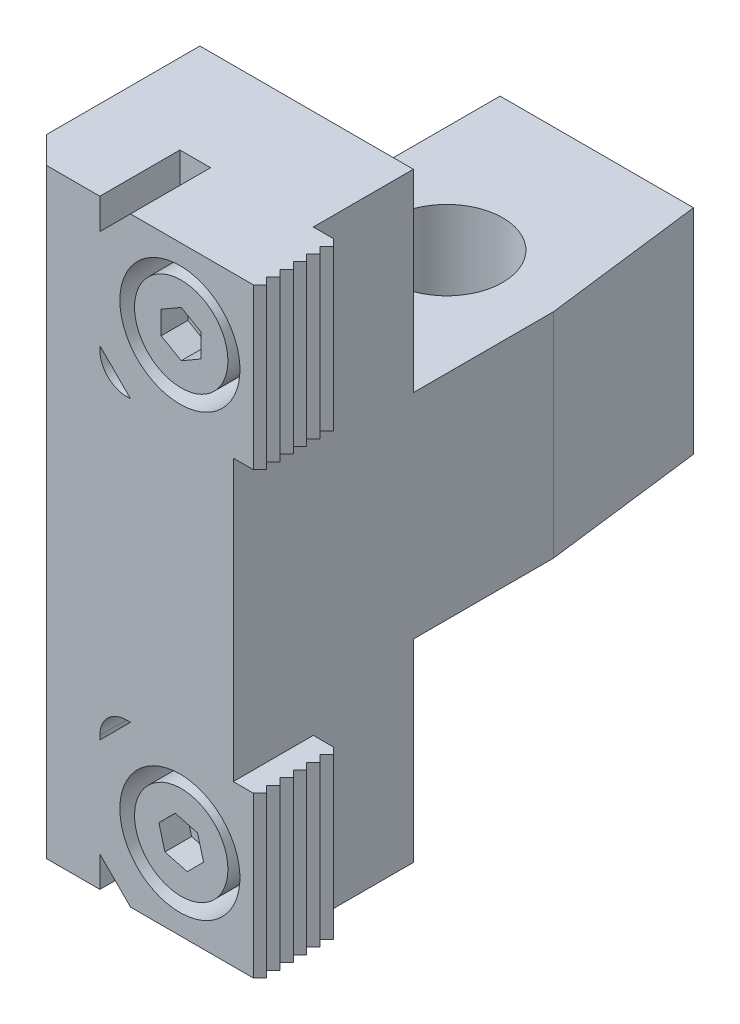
ISO-10303-21;
HEADER;
FILE_DESCRIPTION(('STEP AP214'),'2;1');
FILE_NAME('part.step','',(''),(''),'','','');
FILE_SCHEMA(('AUTOMOTIVE_DESIGN { 1 0 10303 214 1 1 1 1 }'));
ENDSEC;
DATA;
#1=APPLICATION_CONTEXT('core data for automotive mechanical design processes');
#2=APPLICATION_PROTOCOL_DEFINITION('international standard','automotive_design',2000,#1);
#3=PRODUCT_CONTEXT('',#1,'mechanical');
#4=PRODUCT('Part','Part','',(#3));
#5=PRODUCT_RELATED_PRODUCT_CATEGORY('part','',(#4));
#6=PRODUCT_DEFINITION_FORMATION('','',#4);
#7=PRODUCT_DEFINITION_CONTEXT('part definition',#1,'design');
#8=PRODUCT_DEFINITION('design','',#6,#7);
#9=PRODUCT_DEFINITION_SHAPE('','',#8);
#10=(LENGTH_UNIT() NAMED_UNIT(*) SI_UNIT(.MILLI.,.METRE.));
#11=(NAMED_UNIT(*) PLANE_ANGLE_UNIT() SI_UNIT($,.RADIAN.));
#12=(NAMED_UNIT(*) SI_UNIT($,.STERADIAN.) SOLID_ANGLE_UNIT());
#13=UNCERTAINTY_MEASURE_WITH_UNIT(LENGTH_MEASURE(1.E-05),#10,'distance_accuracy_value','');
#14=(GEOMETRIC_REPRESENTATION_CONTEXT(3) GLOBAL_UNCERTAINTY_ASSIGNED_CONTEXT((#13)) GLOBAL_UNIT_ASSIGNED_CONTEXT((#10,
#11,#12)) REPRESENTATION_CONTEXT('',''));
#15=CARTESIAN_POINT('',(0.,0.,0.));
#16=DIRECTION('',(0.,0.,1.));
#17=DIRECTION('',(1.,0.,0.));
#18=AXIS2_PLACEMENT_3D('',#15,#16,#17);
#19=CARTESIAN_POINT('',(4.,16.5,18.));
#20=DIRECTION('',(0.,0.,1.));
#21=DIRECTION('',(-1.,0.,0.));
#22=AXIS2_PLACEMENT_3D('',#19,#20,#21);
#23=CYLINDRICAL_SURFACE('',#22,2.);
#24=CARTESIAN_POINT('',(4.,16.5,10.5));
#25=DIRECTION('',(0.,0.,1.));
#26=DIRECTION('',(-1.,0.,0.));
#27=AXIS2_PLACEMENT_3D('',#24,#25,#26);
#28=CIRCLE('',#27,2.);
#29=CARTESIAN_POINT('',(2.,16.5,10.5));
#30=VERTEX_POINT('',#29);
#31=EDGE_CURVE('E584',#30,#30,#28,.T.);
#32=ORIENTED_EDGE('',*,*,#31,.F.);
#33=EDGE_LOOP('',(#32));
#34=FACE_BOUND('',#33,.T.);
#35=CARTESIAN_POINT('',(4.,16.5,13.9));
#36=DIRECTION('',(0.,0.,1.00000000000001));
#37=DIRECTION('',(0.999999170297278,-0.00128817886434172,0.));
#38=AXIS2_PLACEMENT_3D('',#35,#36,#37);
#39=CIRCLE('',#38,2.);
#40=CARTESIAN_POINT('',(5.99999834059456,16.4974236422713,13.9));
#41=VERTEX_POINT('',#40);
#42=EDGE_CURVE('E1927',#41,#41,#39,.T.);
#43=ORIENTED_EDGE('',*,*,#42,.T.);
#44=EDGE_LOOP('',(#43));
#45=FACE_BOUND('',#44,.T.);
#46=ADVANCED_FACE('F15',(#34,#45),#23,.F.);
#47=CARTESIAN_POINT('',(-8.,22.5,10.5));
#48=DIRECTION('',(0.,0.,1.));
#49=DIRECTION('',(-1.,0.,0.));
#50=AXIS2_PLACEMENT_3D('',#47,#48,#49);
#51=PLANE('',#50);
#52=ORIENTED_EDGE('',*,*,#31,.T.);
#53=EDGE_LOOP('',(#52));
#54=FACE_BOUND('',#53,.T.);
#55=DIRECTION('',(0.,-1.,0.));
#56=VECTOR('',#55,1.);
#57=CARTESIAN_POINT('',(8.,22.5,10.5));
#58=LINE('',#57,#56);
#59=CARTESIAN_POINT('',(8.,22.5,10.5));
#60=VERTEX_POINT('',#59);
#61=CARTESIAN_POINT('',(8.,8.,10.5));
#62=VERTEX_POINT('',#61);
#63=EDGE_CURVE('E644',#60,#62,#58,.T.);
#64=ORIENTED_EDGE('',*,*,#63,.T.);
#65=DIRECTION('',(1.,0.,0.));
#66=VECTOR('',#65,1.);
#67=CARTESIAN_POINT('',(-8.,8.,10.5));
#68=LINE('',#67,#66);
#69=CARTESIAN_POINT('',(-8.,8.,10.5));
#70=VERTEX_POINT('',#69);
#71=EDGE_CURVE('E655',#70,#62,#68,.T.);
#72=ORIENTED_EDGE('',*,*,#71,.F.);
#73=DIRECTION('',(0.,-1.,0.));
#74=VECTOR('',#73,1.);
#75=CARTESIAN_POINT('',(-8.,22.5,10.5));
#76=LINE('',#75,#74);
#77=CARTESIAN_POINT('',(-8.,22.5,10.5));
#78=VERTEX_POINT('',#77);
#79=EDGE_CURVE('E650',#78,#70,#76,.T.);
#80=ORIENTED_EDGE('',*,*,#79,.F.);
#81=DIRECTION('',(1.,0.,0.));
#82=VECTOR('',#81,1.);
#83=CARTESIAN_POINT('',(-8.,22.5,10.5));
#84=LINE('',#83,#82);
#85=EDGE_CURVE('E408',#78,#60,#84,.T.);
#86=ORIENTED_EDGE('',*,*,#85,.T.);
#87=EDGE_LOOP('',(#64,#72,#80,#86));
#88=FACE_BOUND('',#87,.T.);
#89=ADVANCED_FACE('F1236',(#54,#88),#51,.F.);
#90=CARTESIAN_POINT('',(8.,-22.5,24.));
#91=DIRECTION('',(-1.,0.,0.));
#92=DIRECTION('',(0.,-1.,0.));
#93=AXIS2_PLACEMENT_3D('',#90,#91,#92);
#94=PLANE('',#93);
#95=DIRECTION('',(0.,0.,1.));
#96=VECTOR('',#95,1.);
#97=CARTESIAN_POINT('',(8.,-8.,-16.));
#98=LINE('',#97,#96);
#99=CARTESIAN_POINT('',(8.,-8.,0.));
#100=VERTEX_POINT('',#99);
#101=CARTESIAN_POINT('',(8.,-8.,10.5));
#102=VERTEX_POINT('',#101);
#103=EDGE_CURVE('E627',#100,#102,#98,.T.);
#104=ORIENTED_EDGE('',*,*,#103,.F.);
#105=DIRECTION('',(0.,1.,0.));
#106=VECTOR('',#105,1.);
#107=CARTESIAN_POINT('',(8.,-22.5,0.));
#108=LINE('',#107,#106);
#109=CARTESIAN_POINT('',(8.,8.,0.));
#110=VERTEX_POINT('',#109);
#111=EDGE_CURVE('E568',#100,#110,#108,.T.);
#112=ORIENTED_EDGE('',*,*,#111,.T.);
#113=DIRECTION('',(0.,0.,-1.));
#114=VECTOR('',#113,1.);
#115=CARTESIAN_POINT('',(8.,8.,-16.));
#116=LINE('',#115,#114);
#117=EDGE_CURVE('E647',#62,#110,#116,.T.);
#118=ORIENTED_EDGE('',*,*,#117,.F.);
#119=ORIENTED_EDGE('',*,*,#63,.F.);
#120=DIRECTION('',(0.,0.,-1.));
#121=VECTOR('',#120,1.);
#122=CARTESIAN_POINT('',(8.,22.5,24.));
#123=LINE('',#122,#121);
#124=CARTESIAN_POINT('',(8.,22.5,18.));
#125=VERTEX_POINT('',#124);
#126=EDGE_CURVE('E409',#125,#60,#123,.T.);
#127=ORIENTED_EDGE('',*,*,#126,.F.);
#128=DIRECTION('',(0.,-1.,0.));
#129=VECTOR('',#128,1.);
#130=CARTESIAN_POINT('',(8.,22.5,18.));
#131=LINE('',#130,#129);
#132=CARTESIAN_POINT('',(8.,10.5,18.));
#133=VERTEX_POINT('',#132);
#134=EDGE_CURVE('E427',#125,#133,#131,.T.);
#135=ORIENTED_EDGE('',*,*,#134,.T.);
#136=DIRECTION('',(0.,0.,1.));
#137=VECTOR('',#136,1.);
#138=CARTESIAN_POINT('',(8.,10.5,24.));
#139=LINE('',#138,#137);
#140=CARTESIAN_POINT('',(8.,10.5,24.));
#141=VERTEX_POINT('',#140);
#142=EDGE_CURVE('E733',#133,#141,#139,.T.);
#143=ORIENTED_EDGE('',*,*,#142,.T.);
#144=DIRECTION('',(0.,1.,0.));
#145=VECTOR('',#144,1.);
#146=CARTESIAN_POINT('',(8.,-22.5,24.));
#147=LINE('',#146,#145);
#148=CARTESIAN_POINT('',(8.,-10.5,24.));
#149=VERTEX_POINT('',#148);
#150=EDGE_CURVE('E659',#149,#141,#147,.T.);
#151=ORIENTED_EDGE('',*,*,#150,.F.);
#152=DIRECTION('',(0.,0.,1.));
#153=VECTOR('',#152,1.);
#154=CARTESIAN_POINT('',(8.,-10.5,18.));
#155=LINE('',#154,#153);
#156=CARTESIAN_POINT('',(8.,-10.5,18.));
#157=VERTEX_POINT('',#156);
#158=EDGE_CURVE('E560',#157,#149,#155,.T.);
#159=ORIENTED_EDGE('',*,*,#158,.F.);
#160=DIRECTION('',(0.,1.,0.));
#161=VECTOR('',#160,1.);
#162=CARTESIAN_POINT('',(8.,-22.5,18.));
#163=LINE('',#162,#161);
#164=CARTESIAN_POINT('',(8.,-22.5,18.));
#165=VERTEX_POINT('',#164);
#166=EDGE_CURVE('E612',#165,#157,#163,.T.);
#167=ORIENTED_EDGE('',*,*,#166,.F.);
#168=DIRECTION('',(0.,0.,-1.));
#169=VECTOR('',#168,1.);
#170=CARTESIAN_POINT('',(8.,-22.5,24.));
#171=LINE('',#170,#169);
#172=CARTESIAN_POINT('',(8.,-22.5,10.5));
#173=VERTEX_POINT('',#172);
#174=EDGE_CURVE('E667',#165,#173,#171,.T.);
#175=ORIENTED_EDGE('',*,*,#174,.T.);
#176=DIRECTION('',(0.,-1.,0.));
#177=VECTOR('',#176,1.);
#178=CARTESIAN_POINT('',(8.,-22.5,10.5));
#179=LINE('',#178,#177);
#180=EDGE_CURVE('E630',#102,#173,#179,.T.);
#181=ORIENTED_EDGE('',*,*,#180,.F.);
#182=EDGE_LOOP('',(#104,#112,#118,#119,#127,#135,#143,#151,#159,#167,#175,#181));
#183=FACE_BOUND('',#182,.T.);
#184=ADVANCED_FACE('F17',(#183),#94,.F.);
#185=CARTESIAN_POINT('',(-8.,8.,-16.));
#186=DIRECTION('',(0.,-1.,0.));
#187=DIRECTION('',(1.,0.,0.));
#188=AXIS2_PLACEMENT_3D('',#185,#186,#187);
#189=PLANE('',#188);
#190=ORIENTED_EDGE('',*,*,#117,.T.);
#191=DIRECTION('',(0.124034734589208,0.,0.992277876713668));
#192=VECTOR('',#191,1.);
#193=CARTESIAN_POINT('',(6.5,8.,-12.));
#194=LINE('',#193,#192);
#195=CARTESIAN_POINT('',(6.5,8.,-12.));
#196=VERTEX_POINT('',#195);
#197=EDGE_CURVE('E566',#196,#110,#194,.T.);
#198=ORIENTED_EDGE('',*,*,#197,.F.);
#199=DIRECTION('',(1.,0.,0.));
#200=VECTOR('',#199,1.);
#201=CARTESIAN_POINT('',(-8.,8.,-12.));
#202=LINE('',#201,#200);
#203=CARTESIAN_POINT('',(-8.,8.,-12.));
#204=VERTEX_POINT('',#203);
#205=EDGE_CURVE('E574',#204,#196,#202,.T.);
#206=ORIENTED_EDGE('',*,*,#205,.F.);
#207=DIRECTION('',(0.,0.,-1.));
#208=VECTOR('',#207,1.);
#209=CARTESIAN_POINT('',(-8.,8.,-16.));
#210=LINE('',#209,#208);
#211=EDGE_CURVE('E652',#70,#204,#210,.T.);
#212=ORIENTED_EDGE('',*,*,#211,.F.);
#213=ORIENTED_EDGE('',*,*,#71,.T.);
#214=EDGE_LOOP('',(#190,#198,#206,#212,#213));
#215=FACE_BOUND('',#214,.T.);
#216=CARTESIAN_POINT('',(0.,8.,0.));
#217=DIRECTION('',(0.,-1.,0.));
#218=DIRECTION('',(1.,0.,0.));
#219=AXIS2_PLACEMENT_3D('',#216,#217,#218);
#220=CIRCLE('',#219,4.2);
#221=CARTESIAN_POINT('',(4.2,8.,0.));
#222=VERTEX_POINT('',#221);
#223=EDGE_CURVE('E657',#222,#222,#220,.F.);
#224=ORIENTED_EDGE('',*,*,#223,.F.);
#225=EDGE_LOOP('',(#224));
#226=FACE_BOUND('',#225,.T.);
#227=ADVANCED_FACE('F1274',(#215,#226),#189,.F.);
#228=CARTESIAN_POINT('',(-8.,-22.5,24.));
#229=DIRECTION('',(1.,0.,0.));
#230=DIRECTION('',(0.,1.,0.));
#231=AXIS2_PLACEMENT_3D('',#228,#229,#230);
#232=PLANE('',#231);
#233=DIRECTION('',(0.,0.,-1.));
#234=VECTOR('',#233,1.);
#235=CARTESIAN_POINT('',(-8.,-22.5,24.));
#236=LINE('',#235,#234);
#237=CARTESIAN_POINT('',(-8.,-22.5,22.));
#238=VERTEX_POINT('',#237);
#239=CARTESIAN_POINT('',(-8.,-22.5,10.5));
#240=VERTEX_POINT('',#239);
#241=EDGE_CURVE('E399',#238,#240,#236,.T.);
#242=ORIENTED_EDGE('',*,*,#241,.F.);
#243=DIRECTION('',(0.,1.,0.));
#244=VECTOR('',#243,1.);
#245=CARTESIAN_POINT('',(-8.,22.5,22.));
#246=LINE('',#245,#244);
#247=CARTESIAN_POINT('',(-8.,22.5,22.));
#248=VERTEX_POINT('',#247);
#249=EDGE_CURVE('E392',#238,#248,#246,.T.);
#250=ORIENTED_EDGE('',*,*,#249,.T.);
#251=DIRECTION('',(0.,0.,-1.));
#252=VECTOR('',#251,1.);
#253=CARTESIAN_POINT('',(-8.,22.5,24.));
#254=LINE('',#253,#252);
#255=EDGE_CURVE('E396',#248,#78,#254,.T.);
#256=ORIENTED_EDGE('',*,*,#255,.T.);
#257=ORIENTED_EDGE('',*,*,#79,.T.);
#258=ORIENTED_EDGE('',*,*,#211,.T.);
#259=DIRECTION('',(0.,1.,0.));
#260=VECTOR('',#259,1.);
#261=CARTESIAN_POINT('',(-8.,-22.5,-12.));
#262=LINE('',#261,#260);
#263=CARTESIAN_POINT('',(-8.,-8.,-12.));
#264=VERTEX_POINT('',#263);
#265=EDGE_CURVE('E577',#264,#204,#262,.T.);
#266=ORIENTED_EDGE('',*,*,#265,.F.);
#267=DIRECTION('',(0.,0.,1.));
#268=VECTOR('',#267,1.);
#269=CARTESIAN_POINT('',(-8.,-8.,-16.));
#270=LINE('',#269,#268);
#271=CARTESIAN_POINT('',(-8.,-8.,10.5));
#272=VERTEX_POINT('',#271);
#273=EDGE_CURVE('E633',#264,#272,#270,.T.);
#274=ORIENTED_EDGE('',*,*,#273,.T.);
#275=DIRECTION('',(0.,-1.,0.));
#276=VECTOR('',#275,1.);
#277=CARTESIAN_POINT('',(-8.,-22.5,10.5));
#278=LINE('',#277,#276);
#279=EDGE_CURVE('E635',#272,#240,#278,.T.);
#280=ORIENTED_EDGE('',*,*,#279,.T.);
#281=EDGE_LOOP('',(#242,#250,#256,#257,#258,#266,#274,#280));
#282=FACE_BOUND('',#281,.T.);
#283=ADVANCED_FACE('F394',(#282),#232,.F.);
#284=CARTESIAN_POINT('',(8.,22.5,24.));
#285=DIRECTION('',(0.,-1.,0.));
#286=DIRECTION('',(1.,0.,0.));
#287=AXIS2_PLACEMENT_3D('',#284,#285,#286);
#288=PLANE('',#287);
#289=ORIENTED_EDGE('',*,*,#255,.F.);
#290=DIRECTION('',(0.707106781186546,0.,0.707106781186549));
#291=VECTOR('',#290,1.);
#292=CARTESIAN_POINT('',(-6.,22.5,24.));
#293=LINE('',#292,#291);
#294=CARTESIAN_POINT('',(-6.,22.5,24.));
#295=VERTEX_POINT('',#294);
#296=EDGE_CURVE('E19',#248,#295,#293,.T.);
#297=ORIENTED_EDGE('',*,*,#296,.T.);
#298=DIRECTION('',(-1.,0.,0.));
#299=VECTOR('',#298,1.);
#300=CARTESIAN_POINT('',(8.,22.5,24.));
#301=LINE('',#300,#299);
#302=CARTESIAN_POINT('',(-2.,22.5,24.));
#303=VERTEX_POINT('',#302);
#304=EDGE_CURVE('E662',#303,#295,#301,.T.);
#305=ORIENTED_EDGE('',*,*,#304,.F.);
#306=DIRECTION('',(0.,0.,1.));
#307=VECTOR('',#306,1.);
#308=CARTESIAN_POINT('',(-2.,22.5,18.));
#309=LINE('',#308,#307);
#310=CARTESIAN_POINT('',(-2.,22.5,18.));
#311=VERTEX_POINT('',#310);
#312=EDGE_CURVE('E603',#311,#303,#309,.T.);
#313=ORIENTED_EDGE('',*,*,#312,.F.);
#314=DIRECTION('',(-1.,0.,0.));
#315=VECTOR('',#314,1.);
#316=CARTESIAN_POINT('',(8.,22.5,18.));
#317=LINE('',#316,#315);
#318=CARTESIAN_POINT('',(0.3,22.5,18.));
#319=VERTEX_POINT('',#318);
#320=EDGE_CURVE('E594',#319,#311,#317,.T.);
#321=ORIENTED_EDGE('',*,*,#320,.F.);
#322=DIRECTION('',(0.,0.,-1.));
#323=VECTOR('',#322,1.);
#324=CARTESIAN_POINT('',(0.3,22.5,24.));
#325=LINE('',#324,#323);
#326=CARTESIAN_POINT('',(0.3,22.5,24.));
#327=VERTEX_POINT('',#326);
#328=EDGE_CURVE('E759',#327,#319,#325,.T.);
#329=ORIENTED_EDGE('',*,*,#328,.F.);
#330=DIRECTION('',(-1.,0.,0.));
#331=VECTOR('',#330,1.);
#332=CARTESIAN_POINT('',(10.,22.5,24.));
#333=LINE('',#332,#331);
#334=CARTESIAN_POINT('',(9.5,22.5,24.));
#335=VERTEX_POINT('',#334);
#336=EDGE_CURVE('E929',#335,#327,#333,.T.);
#337=ORIENTED_EDGE('',*,*,#336,.F.);
#338=DIRECTION('',(-0.707106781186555,0.,0.707106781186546));
#339=VECTOR('',#338,1.);
#340=CARTESIAN_POINT('',(9.5,22.5,24.));
#341=LINE('',#340,#339);
#342=CARTESIAN_POINT('',(10.,22.5,23.5));
#343=VERTEX_POINT('',#342);
#344=EDGE_CURVE('E849',#343,#335,#341,.T.);
#345=ORIENTED_EDGE('',*,*,#344,.F.);
#346=DIRECTION('',(0.707106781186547,0.,0.707106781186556));
#347=VECTOR('',#346,1.);
#348=CARTESIAN_POINT('',(10.,22.5,23.5));
#349=LINE('',#348,#347);
#350=CARTESIAN_POINT('',(9.5,22.5,23.));
#351=VERTEX_POINT('',#350);
#352=EDGE_CURVE('E846',#351,#343,#349,.T.);
#353=ORIENTED_EDGE('',*,*,#352,.F.);
#354=DIRECTION('',(-0.707106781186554,0.,0.707106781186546));
#355=VECTOR('',#354,1.);
#356=CARTESIAN_POINT('',(9.5,22.5,23.));
#357=LINE('',#356,#355);
#358=CARTESIAN_POINT('',(10.,22.5,22.5));
#359=VERTEX_POINT('',#358);
#360=EDGE_CURVE('E843',#359,#351,#357,.T.);
#361=ORIENTED_EDGE('',*,*,#360,.F.);
#362=DIRECTION('',(0.707106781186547,0.,0.707106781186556));
#363=VECTOR('',#362,1.);
#364=CARTESIAN_POINT('',(10.,22.5,22.5));
#365=LINE('',#364,#363);
#366=CARTESIAN_POINT('',(9.5,22.5,22.));
#367=VERTEX_POINT('',#366);
#368=EDGE_CURVE('E840',#367,#359,#365,.T.);
#369=ORIENTED_EDGE('',*,*,#368,.F.);
#370=DIRECTION('',(-0.707106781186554,0.,0.707106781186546));
#371=VECTOR('',#370,1.);
#372=CARTESIAN_POINT('',(9.5,22.5,22.));
#373=LINE('',#372,#371);
#374=CARTESIAN_POINT('',(10.,22.5,21.5));
#375=VERTEX_POINT('',#374);
#376=EDGE_CURVE('E837',#375,#367,#373,.T.);
#377=ORIENTED_EDGE('',*,*,#376,.F.);
#378=DIRECTION('',(0.707106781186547,0.,0.707106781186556));
#379=VECTOR('',#378,1.);
#380=CARTESIAN_POINT('',(10.,22.5,21.5));
#381=LINE('',#380,#379);
#382=CARTESIAN_POINT('',(9.5,22.5,21.));
#383=VERTEX_POINT('',#382);
#384=EDGE_CURVE('E834',#383,#375,#381,.T.);
#385=ORIENTED_EDGE('',*,*,#384,.F.);
#386=DIRECTION('',(-0.707106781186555,0.,0.707106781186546));
#387=VECTOR('',#386,1.);
#388=CARTESIAN_POINT('',(9.5,22.5,21.));
#389=LINE('',#388,#387);
#390=CARTESIAN_POINT('',(10.,22.5,20.5));
#391=VERTEX_POINT('',#390);
#392=EDGE_CURVE('E831',#391,#383,#389,.T.);
#393=ORIENTED_EDGE('',*,*,#392,.F.);
#394=DIRECTION('',(0.707106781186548,0.,0.707106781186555));
#395=VECTOR('',#394,1.);
#396=CARTESIAN_POINT('',(10.,22.5,20.5));
#397=LINE('',#396,#395);
#398=CARTESIAN_POINT('',(9.5,22.5,20.));
#399=VERTEX_POINT('',#398);
#400=EDGE_CURVE('E828',#399,#391,#397,.T.);
#401=ORIENTED_EDGE('',*,*,#400,.F.);
#402=DIRECTION('',(-0.707106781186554,0.,0.707106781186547));
#403=VECTOR('',#402,1.);
#404=CARTESIAN_POINT('',(9.5,22.5,20.));
#405=LINE('',#404,#403);
#406=CARTESIAN_POINT('',(10.,22.5,19.5));
#407=VERTEX_POINT('',#406);
#408=EDGE_CURVE('E825',#407,#399,#405,.T.);
#409=ORIENTED_EDGE('',*,*,#408,.F.);
#410=DIRECTION('',(0.707106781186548,0.,0.707106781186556));
#411=VECTOR('',#410,1.);
#412=CARTESIAN_POINT('',(10.,22.5,19.5));
#413=LINE('',#412,#411);
#414=CARTESIAN_POINT('',(9.5,22.5,19.));
#415=VERTEX_POINT('',#414);
#416=EDGE_CURVE('E822',#415,#407,#413,.T.);
#417=ORIENTED_EDGE('',*,*,#416,.F.);
#418=DIRECTION('',(-0.707106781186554,0.,0.707106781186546));
#419=VECTOR('',#418,1.);
#420=CARTESIAN_POINT('',(9.5,22.5,19.));
#421=LINE('',#420,#419);
#422=CARTESIAN_POINT('',(10.,22.5,18.5));
#423=VERTEX_POINT('',#422);
#424=EDGE_CURVE('E819',#423,#415,#421,.T.);
#425=ORIENTED_EDGE('',*,*,#424,.F.);
#426=DIRECTION('',(0.707106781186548,0.,0.707106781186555));
#427=VECTOR('',#426,1.);
#428=CARTESIAN_POINT('',(10.,22.5,18.5));
#429=LINE('',#428,#427);
#430=CARTESIAN_POINT('',(9.5,22.5,18.));
#431=VERTEX_POINT('',#430);
#432=EDGE_CURVE('E615',#431,#423,#429,.T.);
#433=ORIENTED_EDGE('',*,*,#432,.F.);
#434=DIRECTION('',(-1.,0.,0.));
#435=VECTOR('',#434,1.);
#436=CARTESIAN_POINT('',(10.,22.5,18.));
#437=LINE('',#436,#435);
#438=EDGE_CURVE('E919',#431,#125,#437,.T.);
#439=ORIENTED_EDGE('',*,*,#438,.T.);
#440=ORIENTED_EDGE('',*,*,#126,.T.);
#441=ORIENTED_EDGE('',*,*,#85,.F.);
#442=EDGE_LOOP('',(#289,#297,#305,#313,#321,#329,#337,#345,#353,#361,#369,#377,#385,#393,#401,
#409,#417,#425,#433,#439,#440,#441));
#443=FACE_BOUND('',#442,.T.);
#444=ADVANCED_FACE('F404',(#443),#288,.F.);
#445=CARTESIAN_POINT('',(-8.,-8.,-16.));
#446=DIRECTION('',(0.,1.,0.));
#447=DIRECTION('',(-1.,0.,0.));
#448=AXIS2_PLACEMENT_3D('',#445,#446,#447);
#449=PLANE('',#448);
#450=DIRECTION('',(1.,0.,0.));
#451=VECTOR('',#450,1.);
#452=CARTESIAN_POINT('',(-8.,-8.,-12.));
#453=LINE('',#452,#451);
#454=CARTESIAN_POINT('',(6.5,-8.,-12.));
#455=VERTEX_POINT('',#454);
#456=EDGE_CURVE('E697',#264,#455,#453,.T.);
#457=ORIENTED_EDGE('',*,*,#456,.T.);
#458=DIRECTION('',(0.124034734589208,0.,0.992277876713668));
#459=VECTOR('',#458,1.);
#460=CARTESIAN_POINT('',(5.7846153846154,-8.,-17.7230769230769));
#461=LINE('',#460,#459);
#462=EDGE_CURVE('E571',#455,#100,#461,.T.);
#463=ORIENTED_EDGE('',*,*,#462,.T.);
#464=ORIENTED_EDGE('',*,*,#103,.T.);
#465=DIRECTION('',(1.,0.,0.));
#466=VECTOR('',#465,1.);
#467=CARTESIAN_POINT('',(-8.,-8.,10.5));
#468=LINE('',#467,#466);
#469=EDGE_CURVE('E637',#272,#102,#468,.T.);
#470=ORIENTED_EDGE('',*,*,#469,.F.);
#471=ORIENTED_EDGE('',*,*,#273,.F.);
#472=EDGE_LOOP('',(#457,#463,#464,#470,#471));
#473=FACE_BOUND('',#472,.T.);
#474=CARTESIAN_POINT('',(0.,-8.,0.));
#475=DIRECTION('',(0.,1.,0.));
#476=DIRECTION('',(-1.,0.,0.));
#477=AXIS2_PLACEMENT_3D('',#474,#475,#476);
#478=CIRCLE('',#477,4.2);
#479=CARTESIAN_POINT('',(-4.2,-8.,0.));
#480=VERTEX_POINT('',#479);
#481=EDGE_CURVE('E641',#480,#480,#478,.F.);
#482=ORIENTED_EDGE('',*,*,#481,.F.);
#483=EDGE_LOOP('',(#482));
#484=FACE_BOUND('',#483,.T.);
#485=ADVANCED_FACE('F1224',(#473,#484),#449,.F.);
#486=CARTESIAN_POINT('',(6.5,-22.5,-12.));
#487=DIRECTION('',(-0.992277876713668,0.,0.124034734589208));
#488=DIRECTION('',(-0.124034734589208,0.,-0.992277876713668));
#489=AXIS2_PLACEMENT_3D('',#486,#487,#488);
#490=PLANE('',#489);
#491=DIRECTION('',(0.,-1.,0.));
#492=VECTOR('',#491,1.);
#493=CARTESIAN_POINT('',(6.5,-22.5,-12.));
#494=LINE('',#493,#492);
#495=EDGE_CURVE('E700',#196,#455,#494,.T.);
#496=ORIENTED_EDGE('',*,*,#495,.F.);
#497=ORIENTED_EDGE('',*,*,#197,.T.);
#498=ORIENTED_EDGE('',*,*,#111,.F.);
#499=ORIENTED_EDGE('',*,*,#462,.F.);
#500=EDGE_LOOP('',(#496,#497,#498,#499));
#501=FACE_BOUND('',#500,.T.);
#502=ADVANCED_FACE('F1135',(#501),#490,.F.);
#503=CARTESIAN_POINT('',(10.,22.5,18.));
#504=DIRECTION('',(0.,0.,1.));
#505=DIRECTION('',(-1.,0.,0.));
#506=AXIS2_PLACEMENT_3D('',#503,#504,#505);
#507=PLANE('',#506);
#508=ORIENTED_EDGE('',*,*,#134,.F.);
#509=ORIENTED_EDGE('',*,*,#438,.F.);
#510=DIRECTION('',(0.,1.,0.));
#511=VECTOR('',#510,1.);
#512=CARTESIAN_POINT('',(9.5,10.5,18.));
#513=LINE('',#512,#511);
#514=CARTESIAN_POINT('',(9.5,10.5,18.));
#515=VERTEX_POINT('',#514);
#516=EDGE_CURVE('E884',#515,#431,#513,.T.);
#517=ORIENTED_EDGE('',*,*,#516,.F.);
#518=DIRECTION('',(1.,0.,0.));
#519=VECTOR('',#518,1.);
#520=CARTESIAN_POINT('',(10.,10.5,18.));
#521=LINE('',#520,#519);
#522=EDGE_CURVE('E927',#133,#515,#521,.T.);
#523=ORIENTED_EDGE('',*,*,#522,.F.);
#524=EDGE_LOOP('',(#508,#509,#517,#523));
#525=FACE_BOUND('',#524,.T.);
#526=ADVANCED_FACE('F1123',(#525),#507,.F.);
#527=CARTESIAN_POINT('',(4.00000000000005,16.5,19.9));
#528=DIRECTION('',(0.,0.,1.));
#529=DIRECTION('',(-1.,0.,0.));
#530=AXIS2_PLACEMENT_3D('',#527,#528,#529);
#531=PLANE('',#530);
#532=CARTESIAN_POINT('',(3.99999999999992,16.5,19.9));
#533=DIRECTION('',(0.,0.,1.00000000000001));
#534=DIRECTION('',(0.999999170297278,-0.00128817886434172,0.));
#535=AXIS2_PLACEMENT_3D('',#532,#533,#534);
#536=CIRCLE('',#535,3.5);
#537=CARTESIAN_POINT('',(7.49999709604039,16.4954913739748,19.9));
#538=VERTEX_POINT('',#537);
#539=EDGE_CURVE('E1933',#538,#538,#536,.T.);
#540=ORIENTED_EDGE('',*,*,#539,.F.);
#541=EDGE_LOOP('',(#540));
#542=FACE_BOUND('',#541,.T.);
#543=CARTESIAN_POINT('',(4.00000000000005,16.5,19.9));
#544=DIRECTION('',(0.,0.,1.));
#545=DIRECTION('',(-1.,0.,0.));
#546=AXIS2_PLACEMENT_3D('',#543,#544,#545);
#547=CIRCLE('',#546,4.5);
#548=CARTESIAN_POINT('',(-0.499999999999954,16.5,19.9));
#549=VERTEX_POINT('',#548);
#550=EDGE_CURVE('E913',#549,#549,#547,.T.);
#551=ORIENTED_EDGE('',*,*,#550,.T.);
#552=EDGE_LOOP('',(#551));
#553=FACE_BOUND('',#552,.T.);
#554=ADVANCED_FACE('F958',(#542,#553),#531,.T.);
#555=CARTESIAN_POINT('',(4.00000000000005,16.5,19.9));
#556=DIRECTION('',(0.,0.,1.));
#557=DIRECTION('',(-1.,0.,0.));
#558=AXIS2_PLACEMENT_3D('',#555,#556,#557);
#559=CYLINDRICAL_SURFACE('',#558,4.5);
#560=ORIENTED_EDGE('',*,*,#550,.F.);
#561=EDGE_LOOP('',(#560));
#562=FACE_BOUND('',#561,.T.);
#563=CARTESIAN_POINT('',(4.00000000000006,16.5,24.));
#564=DIRECTION('',(0.,0.,1.));
#565=DIRECTION('',(-1.,0.,0.));
#566=AXIS2_PLACEMENT_3D('',#563,#564,#565);
#567=CIRCLE('',#566,4.5);
#568=CARTESIAN_POINT('',(-0.49999999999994,16.5,24.));
#569=VERTEX_POINT('',#568);
#570=EDGE_CURVE('E887',#569,#569,#567,.T.);
#571=ORIENTED_EDGE('',*,*,#570,.T.);
#572=EDGE_LOOP('',(#571));
#573=FACE_BOUND('',#572,.T.);
#574=ADVANCED_FACE('F1081',(#562,#573),#559,.F.);
#575=CARTESIAN_POINT('',(9.5,10.5,24.));
#576=DIRECTION('',(-0.707106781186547,0.,-0.707106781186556));
#577=DIRECTION('',(0.707106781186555,0.,-0.707106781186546));
#578=AXIS2_PLACEMENT_3D('',#575,#576,#577);
#579=PLANE('',#578);
#580=ORIENTED_EDGE('',*,*,#344,.T.);
#581=DIRECTION('',(0.,1.,0.));
#582=VECTOR('',#581,1.);
#583=CARTESIAN_POINT('',(9.5,10.5,24.));
#584=LINE('',#583,#582);
#585=CARTESIAN_POINT('',(9.5,10.5,24.));
#586=VERTEX_POINT('',#585);
#587=EDGE_CURVE('E885',#586,#335,#584,.T.);
#588=ORIENTED_EDGE('',*,*,#587,.F.);
#589=DIRECTION('',(-0.707106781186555,0.,0.707106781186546));
#590=VECTOR('',#589,1.);
#591=CARTESIAN_POINT('',(9.5,10.5,24.));
#592=LINE('',#591,#590);
#593=CARTESIAN_POINT('',(10.,10.5,23.5));
#594=VERTEX_POINT('',#593);
#595=EDGE_CURVE('E744',#594,#586,#592,.T.);
#596=ORIENTED_EDGE('',*,*,#595,.F.);
#597=DIRECTION('',(0.,1.,0.));
#598=VECTOR('',#597,1.);
#599=CARTESIAN_POINT('',(10.,10.5,23.5));
#600=LINE('',#599,#598);
#601=EDGE_CURVE('E888',#594,#343,#600,.T.);
#602=ORIENTED_EDGE('',*,*,#601,.T.);
#603=EDGE_LOOP('',(#580,#588,#596,#602));
#604=FACE_BOUND('',#603,.T.);
#605=ADVANCED_FACE('F960',(#604),#579,.F.);
#606=CARTESIAN_POINT('',(-2.,20.2,24.));
#607=DIRECTION('',(0.707106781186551,-0.707106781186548,0.));
#608=DIRECTION('',(0.70710678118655,0.707106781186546,0.));
#609=AXIS2_PLACEMENT_3D('',#606,#607,#608);
#610=PLANE('',#609);
#611=DIRECTION('',(-0.70710678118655,-0.707106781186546,0.));
#612=VECTOR('',#611,1.);
#613=CARTESIAN_POINT('',(-2.,20.2,18.));
#614=LINE('',#613,#612);
#615=CARTESIAN_POINT('',(-2.,20.2,18.));
#616=VERTEX_POINT('',#615);
#617=EDGE_CURVE('E922',#319,#616,#614,.T.);
#618=ORIENTED_EDGE('',*,*,#617,.T.);
#619=DIRECTION('',(0.,0.,-1.));
#620=VECTOR('',#619,1.);
#621=CARTESIAN_POINT('',(-2.,20.2,24.));
#622=LINE('',#621,#620);
#623=CARTESIAN_POINT('',(-2.,20.2,24.));
#624=VERTEX_POINT('',#623);
#625=EDGE_CURVE('E757',#624,#616,#622,.T.);
#626=ORIENTED_EDGE('',*,*,#625,.F.);
#627=DIRECTION('',(-0.70710678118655,-0.707106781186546,0.));
#628=VECTOR('',#627,1.);
#629=CARTESIAN_POINT('',(-2.,20.2,24.));
#630=LINE('',#629,#628);
#631=EDGE_CURVE('E752',#327,#624,#630,.T.);
#632=ORIENTED_EDGE('',*,*,#631,.F.);
#633=ORIENTED_EDGE('',*,*,#328,.T.);
#634=EDGE_LOOP('',(#618,#626,#632,#633));
#635=FACE_BOUND('',#634,.T.);
#636=ADVANCED_FACE('F935',(#635),#610,.F.);
#637=CARTESIAN_POINT('',(0.3,10.5,24.));
#638=DIRECTION('',(0.70710678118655,0.707106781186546,0.));
#639=DIRECTION('',(-0.707106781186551,0.707106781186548,0.));
#640=AXIS2_PLACEMENT_3D('',#637,#638,#639);
#641=PLANE('',#640);
#642=DIRECTION('',(0.707106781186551,-0.707106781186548,0.));
#643=VECTOR('',#642,1.);
#644=CARTESIAN_POINT('',(0.3,10.5,18.));
#645=LINE('',#644,#643);
#646=CARTESIAN_POINT('',(-2.,12.8,18.));
#647=VERTEX_POINT('',#646);
#648=CARTESIAN_POINT('',(0.3,10.5,18.));
#649=VERTEX_POINT('',#648);
#650=EDGE_CURVE('E925',#647,#649,#645,.T.);
#651=ORIENTED_EDGE('',*,*,#650,.T.);
#652=DIRECTION('',(0.,0.,-1.));
#653=VECTOR('',#652,1.);
#654=CARTESIAN_POINT('',(0.3,10.5,24.));
#655=LINE('',#654,#653);
#656=CARTESIAN_POINT('',(0.3,10.5,24.));
#657=VERTEX_POINT('',#656);
#658=EDGE_CURVE('E745',#657,#649,#655,.T.);
#659=ORIENTED_EDGE('',*,*,#658,.F.);
#660=DIRECTION('',(0.707106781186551,-0.707106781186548,0.));
#661=VECTOR('',#660,1.);
#662=CARTESIAN_POINT('',(0.3,10.5,24.));
#663=LINE('',#662,#661);
#664=CARTESIAN_POINT('',(-2.,12.8,24.));
#665=VERTEX_POINT('',#664);
#666=EDGE_CURVE('E746',#665,#657,#663,.T.);
#667=ORIENTED_EDGE('',*,*,#666,.F.);
#668=DIRECTION('',(0.,0.,-1.));
#669=VECTOR('',#668,1.);
#670=CARTESIAN_POINT('',(-2.,12.8,24.));
#671=LINE('',#670,#669);
#672=EDGE_CURVE('E749',#665,#647,#671,.T.);
#673=ORIENTED_EDGE('',*,*,#672,.T.);
#674=EDGE_LOOP('',(#651,#659,#667,#673));
#675=FACE_BOUND('',#674,.T.);
#676=ADVANCED_FACE('F1139',(#675),#641,.F.);
#677=CARTESIAN_POINT('',(10.,10.5,24.));
#678=DIRECTION('',(0.,1.,0.));
#679=DIRECTION('',(0.,0.,-1.));
#680=AXIS2_PLACEMENT_3D('',#677,#678,#679);
#681=PLANE('',#680);
#682=ORIENTED_EDGE('',*,*,#142,.F.);
#683=ORIENTED_EDGE('',*,*,#522,.T.);
#684=DIRECTION('',(0.707106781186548,0.,0.707106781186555));
#685=VECTOR('',#684,1.);
#686=CARTESIAN_POINT('',(10.,10.5,18.5));
#687=LINE('',#686,#685);
#688=CARTESIAN_POINT('',(10.,10.5,18.5));
#689=VERTEX_POINT('',#688);
#690=EDGE_CURVE('E851',#515,#689,#687,.T.);
#691=ORIENTED_EDGE('',*,*,#690,.T.);
#692=DIRECTION('',(-0.707106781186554,0.,0.707106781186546));
#693=VECTOR('',#692,1.);
#694=CARTESIAN_POINT('',(9.5,10.5,19.));
#695=LINE('',#694,#693);
#696=CARTESIAN_POINT('',(9.5,10.5,19.));
#697=VERTEX_POINT('',#696);
#698=EDGE_CURVE('E854',#689,#697,#695,.T.);
#699=ORIENTED_EDGE('',*,*,#698,.T.);
#700=DIRECTION('',(0.707106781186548,0.,0.707106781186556));
#701=VECTOR('',#700,1.);
#702=CARTESIAN_POINT('',(10.,10.5,19.5));
#703=LINE('',#702,#701);
#704=CARTESIAN_POINT('',(10.,10.5,19.5));
#705=VERTEX_POINT('',#704);
#706=EDGE_CURVE('E857',#697,#705,#703,.T.);
#707=ORIENTED_EDGE('',*,*,#706,.T.);
#708=DIRECTION('',(-0.707106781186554,0.,0.707106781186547));
#709=VECTOR('',#708,1.);
#710=CARTESIAN_POINT('',(9.5,10.5,20.));
#711=LINE('',#710,#709);
#712=CARTESIAN_POINT('',(9.5,10.5,20.));
#713=VERTEX_POINT('',#712);
#714=EDGE_CURVE('E860',#705,#713,#711,.T.);
#715=ORIENTED_EDGE('',*,*,#714,.T.);
#716=DIRECTION('',(0.707106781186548,0.,0.707106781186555));
#717=VECTOR('',#716,1.);
#718=CARTESIAN_POINT('',(10.,10.5,20.5));
#719=LINE('',#718,#717);
#720=CARTESIAN_POINT('',(10.,10.5,20.5));
#721=VERTEX_POINT('',#720);
#722=EDGE_CURVE('E863',#713,#721,#719,.T.);
#723=ORIENTED_EDGE('',*,*,#722,.T.);
#724=DIRECTION('',(-0.707106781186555,0.,0.707106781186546));
#725=VECTOR('',#724,1.);
#726=CARTESIAN_POINT('',(9.5,10.5,21.));
#727=LINE('',#726,#725);
#728=CARTESIAN_POINT('',(9.5,10.5,21.));
#729=VERTEX_POINT('',#728);
#730=EDGE_CURVE('E866',#721,#729,#727,.T.);
#731=ORIENTED_EDGE('',*,*,#730,.T.);
#732=DIRECTION('',(0.707106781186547,0.,0.707106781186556));
#733=VECTOR('',#732,1.);
#734=CARTESIAN_POINT('',(10.,10.5,21.5));
#735=LINE('',#734,#733);
#736=CARTESIAN_POINT('',(10.,10.5,21.5));
#737=VERTEX_POINT('',#736);
#738=EDGE_CURVE('E869',#729,#737,#735,.T.);
#739=ORIENTED_EDGE('',*,*,#738,.T.);
#740=DIRECTION('',(-0.707106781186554,0.,0.707106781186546));
#741=VECTOR('',#740,1.);
#742=CARTESIAN_POINT('',(9.5,10.5,22.));
#743=LINE('',#742,#741);
#744=CARTESIAN_POINT('',(9.5,10.5,22.));
#745=VERTEX_POINT('',#744);
#746=EDGE_CURVE('E872',#737,#745,#743,.T.);
#747=ORIENTED_EDGE('',*,*,#746,.T.);
#748=DIRECTION('',(0.707106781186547,0.,0.707106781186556));
#749=VECTOR('',#748,1.);
#750=CARTESIAN_POINT('',(10.,10.5,22.5));
#751=LINE('',#750,#749);
#752=CARTESIAN_POINT('',(10.,10.5,22.5));
#753=VERTEX_POINT('',#752);
#754=EDGE_CURVE('E875',#745,#753,#751,.T.);
#755=ORIENTED_EDGE('',*,*,#754,.T.);
#756=DIRECTION('',(-0.707106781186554,0.,0.707106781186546));
#757=VECTOR('',#756,1.);
#758=CARTESIAN_POINT('',(9.5,10.5,23.));
#759=LINE('',#758,#757);
#760=CARTESIAN_POINT('',(9.5,10.5,23.));
#761=VERTEX_POINT('',#760);
#762=EDGE_CURVE('E878',#753,#761,#759,.T.);
#763=ORIENTED_EDGE('',*,*,#762,.T.);
#764=DIRECTION('',(0.707106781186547,0.,0.707106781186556));
#765=VECTOR('',#764,1.);
#766=CARTESIAN_POINT('',(10.,10.5,23.5));
#767=LINE('',#766,#765);
#768=EDGE_CURVE('E881',#761,#594,#767,.T.);
#769=ORIENTED_EDGE('',*,*,#768,.T.);
#770=ORIENTED_EDGE('',*,*,#595,.T.);
#771=DIRECTION('',(1.,0.,0.));
#772=VECTOR('',#771,1.);
#773=CARTESIAN_POINT('',(10.,10.5,24.));
#774=LINE('',#773,#772);
#775=EDGE_CURVE('E736',#141,#586,#774,.T.);
#776=ORIENTED_EDGE('',*,*,#775,.F.);
#777=EDGE_LOOP('',(#682,#683,#691,#699,#707,#715,#723,#731,#739,#747,#755,#763,#769,#770,#776));
#778=FACE_BOUND('',#777,.T.);
#779=ADVANCED_FACE('F740',(#778),#681,.F.);
#780=CARTESIAN_POINT('',(10.,-10.5,24.));
#781=DIRECTION('',(0.,-1.,0.));
#782=DIRECTION('',(0.,0.,1.));
#783=AXIS2_PLACEMENT_3D('',#780,#781,#782);
#784=PLANE('',#783);
#785=DIRECTION('',(-1.,0.,0.));
#786=VECTOR('',#785,1.);
#787=CARTESIAN_POINT('',(10.,-10.5,18.));
#788=LINE('',#787,#786);
#789=CARTESIAN_POINT('',(9.5,-10.5,18.));
#790=VERTEX_POINT('',#789);
#791=EDGE_CURVE('E530',#790,#157,#788,.T.);
#792=ORIENTED_EDGE('',*,*,#791,.T.);
#793=ORIENTED_EDGE('',*,*,#158,.T.);
#794=DIRECTION('',(-1.,0.,0.));
#795=VECTOR('',#794,1.);
#796=CARTESIAN_POINT('',(10.,-10.5,24.));
#797=LINE('',#796,#795);
#798=CARTESIAN_POINT('',(9.5,-10.5,24.));
#799=VERTEX_POINT('',#798);
#800=EDGE_CURVE('E540',#799,#149,#797,.T.);
#801=ORIENTED_EDGE('',*,*,#800,.F.);
#802=DIRECTION('',(-0.707106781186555,0.,0.707106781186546));
#803=VECTOR('',#802,1.);
#804=CARTESIAN_POINT('',(9.5,-10.5,24.));
#805=LINE('',#804,#803);
#806=CARTESIAN_POINT('',(10.,-10.5,23.5));
#807=VERTEX_POINT('',#806);
#808=EDGE_CURVE('E456',#807,#799,#805,.T.);
#809=ORIENTED_EDGE('',*,*,#808,.F.);
#810=DIRECTION('',(0.707106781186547,0.,0.707106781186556));
#811=VECTOR('',#810,1.);
#812=CARTESIAN_POINT('',(10.,-10.5,23.5));
#813=LINE('',#812,#811);
#814=CARTESIAN_POINT('',(9.5,-10.5,23.));
#815=VERTEX_POINT('',#814);
#816=EDGE_CURVE('E453',#815,#807,#813,.T.);
#817=ORIENTED_EDGE('',*,*,#816,.F.);
#818=DIRECTION('',(-0.707106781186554,0.,0.707106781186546));
#819=VECTOR('',#818,1.);
#820=CARTESIAN_POINT('',(9.5,-10.5,23.));
#821=LINE('',#820,#819);
#822=CARTESIAN_POINT('',(10.,-10.5,22.5));
#823=VERTEX_POINT('',#822);
#824=EDGE_CURVE('E450',#823,#815,#821,.T.);
#825=ORIENTED_EDGE('',*,*,#824,.F.);
#826=DIRECTION('',(0.707106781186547,0.,0.707106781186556));
#827=VECTOR('',#826,1.);
#828=CARTESIAN_POINT('',(10.,-10.5,22.5));
#829=LINE('',#828,#827);
#830=CARTESIAN_POINT('',(9.5,-10.5,22.));
#831=VERTEX_POINT('',#830);
#832=EDGE_CURVE('E447',#831,#823,#829,.T.);
#833=ORIENTED_EDGE('',*,*,#832,.F.);
#834=DIRECTION('',(-0.707106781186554,0.,0.707106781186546));
#835=VECTOR('',#834,1.);
#836=CARTESIAN_POINT('',(9.5,-10.5,22.));
#837=LINE('',#836,#835);
#838=CARTESIAN_POINT('',(10.,-10.5,21.5));
#839=VERTEX_POINT('',#838);
#840=EDGE_CURVE('E444',#839,#831,#837,.T.);
#841=ORIENTED_EDGE('',*,*,#840,.F.);
#842=DIRECTION('',(0.707106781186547,0.,0.707106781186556));
#843=VECTOR('',#842,1.);
#844=CARTESIAN_POINT('',(10.,-10.5,21.5));
#845=LINE('',#844,#843);
#846=CARTESIAN_POINT('',(9.5,-10.5,21.));
#847=VERTEX_POINT('',#846);
#848=EDGE_CURVE('E441',#847,#839,#845,.T.);
#849=ORIENTED_EDGE('',*,*,#848,.F.);
#850=DIRECTION('',(-0.707106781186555,0.,0.707106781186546));
#851=VECTOR('',#850,1.);
#852=CARTESIAN_POINT('',(9.5,-10.5,21.));
#853=LINE('',#852,#851);
#854=CARTESIAN_POINT('',(10.,-10.5,20.5));
#855=VERTEX_POINT('',#854);
#856=EDGE_CURVE('E438',#855,#847,#853,.T.);
#857=ORIENTED_EDGE('',*,*,#856,.F.);
#858=DIRECTION('',(0.707106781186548,0.,0.707106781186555));
#859=VECTOR('',#858,1.);
#860=CARTESIAN_POINT('',(10.,-10.5,20.5));
#861=LINE('',#860,#859);
#862=CARTESIAN_POINT('',(9.5,-10.5,20.));
#863=VERTEX_POINT('',#862);
#864=EDGE_CURVE('E435',#863,#855,#861,.T.);
#865=ORIENTED_EDGE('',*,*,#864,.F.);
#866=DIRECTION('',(-0.707106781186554,0.,0.707106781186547));
#867=VECTOR('',#866,1.);
#868=CARTESIAN_POINT('',(9.5,-10.5,20.));
#869=LINE('',#868,#867);
#870=CARTESIAN_POINT('',(10.,-10.5,19.5));
#871=VERTEX_POINT('',#870);
#872=EDGE_CURVE('E432',#871,#863,#869,.T.);
#873=ORIENTED_EDGE('',*,*,#872,.F.);
#874=DIRECTION('',(0.707106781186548,0.,0.707106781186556));
#875=VECTOR('',#874,1.);
#876=CARTESIAN_POINT('',(10.,-10.5,19.5));
#877=LINE('',#876,#875);
#878=CARTESIAN_POINT('',(9.5,-10.5,19.));
#879=VERTEX_POINT('',#878);
#880=EDGE_CURVE('E424',#879,#871,#877,.T.);
#881=ORIENTED_EDGE('',*,*,#880,.F.);
#882=DIRECTION('',(-0.707106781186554,0.,0.707106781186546));
#883=VECTOR('',#882,1.);
#884=CARTESIAN_POINT('',(9.5,-10.5,19.));
#885=LINE('',#884,#883);
#886=CARTESIAN_POINT('',(10.,-10.5,18.5));
#887=VERTEX_POINT('',#886);
#888=EDGE_CURVE('E417',#887,#879,#885,.T.);
#889=ORIENTED_EDGE('',*,*,#888,.F.);
#890=DIRECTION('',(0.707106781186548,0.,0.707106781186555));
#891=VECTOR('',#890,1.);
#892=CARTESIAN_POINT('',(10.,-10.5,18.5));
#893=LINE('',#892,#891);
#894=EDGE_CURVE('E415',#790,#887,#893,.T.);
#895=ORIENTED_EDGE('',*,*,#894,.F.);
#896=EDGE_LOOP('',(#792,#793,#801,#809,#817,#825,#833,#841,#849,#857,#865,#873,#881,#889,#895));
#897=FACE_BOUND('',#896,.T.);
#898=ADVANCED_FACE('F726',(#897),#784,.F.);
#899=CARTESIAN_POINT('',(10.,-10.5,18.));
#900=DIRECTION('',(0.,0.,1.));
#901=DIRECTION('',(-1.,0.,0.));
#902=AXIS2_PLACEMENT_3D('',#899,#900,#901);
#903=PLANE('',#902);
#904=DIRECTION('',(1.,0.,0.));
#905=VECTOR('',#904,1.);
#906=CARTESIAN_POINT('',(10.,-22.5,18.));
#907=LINE('',#906,#905);
#908=CARTESIAN_POINT('',(9.5,-22.5,18.));
#909=VERTEX_POINT('',#908);
#910=EDGE_CURVE('E538',#165,#909,#907,.T.);
#911=ORIENTED_EDGE('',*,*,#910,.F.);
#912=ORIENTED_EDGE('',*,*,#166,.T.);
#913=ORIENTED_EDGE('',*,*,#791,.F.);
#914=DIRECTION('',(0.,1.,0.));
#915=VECTOR('',#914,1.);
#916=CARTESIAN_POINT('',(9.5,-22.5,18.));
#917=LINE('',#916,#915);
#918=EDGE_CURVE('E494',#909,#790,#917,.T.);
#919=ORIENTED_EDGE('',*,*,#918,.F.);
#920=EDGE_LOOP('',(#911,#912,#913,#919));
#921=FACE_BOUND('',#920,.T.);
#922=ADVANCED_FACE('F1192',(#921),#903,.F.);
#923=CARTESIAN_POINT('',(8.,-22.5,24.));
#924=DIRECTION('',(0.,1.,0.));
#925=DIRECTION('',(-1.,0.,0.));
#926=AXIS2_PLACEMENT_3D('',#923,#924,#925);
#927=PLANE('',#926);
#928=DIRECTION('',(1.,0.,0.));
#929=VECTOR('',#928,1.);
#930=CARTESIAN_POINT('',(8.,-22.5,24.));
#931=LINE('',#930,#929);
#932=CARTESIAN_POINT('',(-6.,-22.5,24.));
#933=VERTEX_POINT('',#932);
#934=CARTESIAN_POINT('',(-2.,-22.5,24.));
#935=VERTEX_POINT('',#934);
#936=EDGE_CURVE('E664',#933,#935,#931,.T.);
#937=ORIENTED_EDGE('',*,*,#936,.F.);
#938=DIRECTION('',(-0.707106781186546,0.,-0.707106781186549));
#939=VECTOR('',#938,1.);
#940=CARTESIAN_POINT('',(-6.,-22.5,24.));
#941=LINE('',#940,#939);
#942=EDGE_CURVE('E387',#933,#238,#941,.T.);
#943=ORIENTED_EDGE('',*,*,#942,.T.);
#944=ORIENTED_EDGE('',*,*,#241,.T.);
#945=DIRECTION('',(1.,0.,0.));
#946=VECTOR('',#945,1.);
#947=CARTESIAN_POINT('',(-8.,-22.5,10.5));
#948=LINE('',#947,#946);
#949=EDGE_CURVE('E638',#240,#173,#948,.T.);
#950=ORIENTED_EDGE('',*,*,#949,.T.);
#951=ORIENTED_EDGE('',*,*,#174,.F.);
#952=ORIENTED_EDGE('',*,*,#910,.T.);
#953=DIRECTION('',(0.707106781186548,0.,0.707106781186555));
#954=VECTOR('',#953,1.);
#955=CARTESIAN_POINT('',(10.,-22.5,18.5));
#956=LINE('',#955,#954);
#957=CARTESIAN_POINT('',(10.,-22.5,18.5));
#958=VERTEX_POINT('',#957);
#959=EDGE_CURVE('E458',#909,#958,#956,.T.);
#960=ORIENTED_EDGE('',*,*,#959,.T.);
#961=DIRECTION('',(-0.707106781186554,0.,0.707106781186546));
#962=VECTOR('',#961,1.);
#963=CARTESIAN_POINT('',(9.5,-22.5,19.));
#964=LINE('',#963,#962);
#965=CARTESIAN_POINT('',(9.5,-22.5,19.));
#966=VERTEX_POINT('',#965);
#967=EDGE_CURVE('E461',#958,#966,#964,.T.);
#968=ORIENTED_EDGE('',*,*,#967,.T.);
#969=DIRECTION('',(0.707106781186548,0.,0.707106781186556));
#970=VECTOR('',#969,1.);
#971=CARTESIAN_POINT('',(10.,-22.5,19.5));
#972=LINE('',#971,#970);
#973=CARTESIAN_POINT('',(10.,-22.5,19.5));
#974=VERTEX_POINT('',#973);
#975=EDGE_CURVE('E464',#966,#974,#972,.T.);
#976=ORIENTED_EDGE('',*,*,#975,.T.);
#977=DIRECTION('',(-0.707106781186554,0.,0.707106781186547));
#978=VECTOR('',#977,1.);
#979=CARTESIAN_POINT('',(9.5,-22.5,20.));
#980=LINE('',#979,#978);
#981=CARTESIAN_POINT('',(9.5,-22.5,20.));
#982=VERTEX_POINT('',#981);
#983=EDGE_CURVE('E467',#974,#982,#980,.T.);
#984=ORIENTED_EDGE('',*,*,#983,.T.);
#985=DIRECTION('',(0.707106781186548,0.,0.707106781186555));
#986=VECTOR('',#985,1.);
#987=CARTESIAN_POINT('',(10.,-22.5,20.5));
#988=LINE('',#987,#986);
#989=CARTESIAN_POINT('',(10.,-22.5,20.5));
#990=VERTEX_POINT('',#989);
#991=EDGE_CURVE('E470',#982,#990,#988,.T.);
#992=ORIENTED_EDGE('',*,*,#991,.T.);
#993=DIRECTION('',(-0.707106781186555,0.,0.707106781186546));
#994=VECTOR('',#993,1.);
#995=CARTESIAN_POINT('',(9.5,-22.5,21.));
#996=LINE('',#995,#994);
#997=CARTESIAN_POINT('',(9.5,-22.5,21.));
#998=VERTEX_POINT('',#997);
#999=EDGE_CURVE('E473',#990,#998,#996,.T.);
#1000=ORIENTED_EDGE('',*,*,#999,.T.);
#1001=DIRECTION('',(0.707106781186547,0.,0.707106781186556));
#1002=VECTOR('',#1001,1.);
#1003=CARTESIAN_POINT('',(10.,-22.5,21.5));
#1004=LINE('',#1003,#1002);
#1005=CARTESIAN_POINT('',(10.,-22.5,21.5));
#1006=VERTEX_POINT('',#1005);
#1007=EDGE_CURVE('E476',#998,#1006,#1004,.T.);
#1008=ORIENTED_EDGE('',*,*,#1007,.T.);
#1009=DIRECTION('',(-0.707106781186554,0.,0.707106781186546));
#1010=VECTOR('',#1009,1.);
#1011=CARTESIAN_POINT('',(9.5,-22.5,22.));
#1012=LINE('',#1011,#1010);
#1013=CARTESIAN_POINT('',(9.5,-22.5,22.));
#1014=VERTEX_POINT('',#1013);
#1015=EDGE_CURVE('E479',#1006,#1014,#1012,.T.);
#1016=ORIENTED_EDGE('',*,*,#1015,.T.);
#1017=DIRECTION('',(0.707106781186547,0.,0.707106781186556));
#1018=VECTOR('',#1017,1.);
#1019=CARTESIAN_POINT('',(10.,-22.5,22.5));
#1020=LINE('',#1019,#1018);
#1021=CARTESIAN_POINT('',(10.,-22.5,22.5));
#1022=VERTEX_POINT('',#1021);
#1023=EDGE_CURVE('E482',#1014,#1022,#1020,.T.);
#1024=ORIENTED_EDGE('',*,*,#1023,.T.);
#1025=DIRECTION('',(-0.707106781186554,0.,0.707106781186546));
#1026=VECTOR('',#1025,1.);
#1027=CARTESIAN_POINT('',(9.5,-22.5,23.));
#1028=LINE('',#1027,#1026);
#1029=CARTESIAN_POINT('',(9.5,-22.5,23.));
#1030=VERTEX_POINT('',#1029);
#1031=EDGE_CURVE('E485',#1022,#1030,#1028,.T.);
#1032=ORIENTED_EDGE('',*,*,#1031,.T.);
#1033=DIRECTION('',(0.707106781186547,0.,0.707106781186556));
#1034=VECTOR('',#1033,1.);
#1035=CARTESIAN_POINT('',(10.,-22.5,23.5));
#1036=LINE('',#1035,#1034);
#1037=CARTESIAN_POINT('',(10.,-22.5,23.5));
#1038=VERTEX_POINT('',#1037);
#1039=EDGE_CURVE('E488',#1030,#1038,#1036,.T.);
#1040=ORIENTED_EDGE('',*,*,#1039,.T.);
#1041=DIRECTION('',(-0.707106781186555,0.,0.707106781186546));
#1042=VECTOR('',#1041,1.);
#1043=CARTESIAN_POINT('',(9.5,-22.5,24.));
#1044=LINE('',#1043,#1042);
#1045=CARTESIAN_POINT('',(9.5,-22.5,24.));
#1046=VERTEX_POINT('',#1045);
#1047=EDGE_CURVE('E491',#1038,#1046,#1044,.T.);
#1048=ORIENTED_EDGE('',*,*,#1047,.T.);
#1049=DIRECTION('',(1.,0.,0.));
#1050=VECTOR('',#1049,1.);
#1051=CARTESIAN_POINT('',(10.,-22.5,24.));
#1052=LINE('',#1051,#1050);
#1053=CARTESIAN_POINT('',(0.3,-22.5,24.));
#1054=VERTEX_POINT('',#1053);
#1055=EDGE_CURVE('E548',#1054,#1046,#1052,.T.);
#1056=ORIENTED_EDGE('',*,*,#1055,.F.);
#1057=DIRECTION('',(0.,0.,-1.));
#1058=VECTOR('',#1057,1.);
#1059=CARTESIAN_POINT('',(0.3,-22.5,24.));
#1060=LINE('',#1059,#1058);
#1061=CARTESIAN_POINT('',(0.3,-22.5,18.));
#1062=VERTEX_POINT('',#1061);
#1063=EDGE_CURVE('E551',#1054,#1062,#1060,.T.);
#1064=ORIENTED_EDGE('',*,*,#1063,.T.);
#1065=DIRECTION('',(1.,0.,0.));
#1066=VECTOR('',#1065,1.);
#1067=CARTESIAN_POINT('',(8.,-22.5,18.));
#1068=LINE('',#1067,#1066);
#1069=CARTESIAN_POINT('',(-2.,-22.5,18.));
#1070=VERTEX_POINT('',#1069);
#1071=EDGE_CURVE('E621',#1070,#1062,#1068,.T.);
#1072=ORIENTED_EDGE('',*,*,#1071,.F.);
#1073=DIRECTION('',(0.,0.,1.));
#1074=VECTOR('',#1073,1.);
#1075=CARTESIAN_POINT('',(-2.,-22.5,18.));
#1076=LINE('',#1075,#1074);
#1077=EDGE_CURVE('E624',#1070,#935,#1076,.T.);
#1078=ORIENTED_EDGE('',*,*,#1077,.T.);
#1079=EDGE_LOOP('',(#937,#943,#944,#950,#951,#952,#960,#968,#976,#984,#992,#1000,#1008,#1016,
#1024,#1032,#1040,#1048,#1056,#1064,#1072,#1078));
#1080=FACE_BOUND('',#1079,.T.);
#1081=ADVANCED_FACE('F709',(#1080),#927,.F.);
#1082=CARTESIAN_POINT('',(-8.,-22.5,10.5));
#1083=DIRECTION('',(0.,0.,1.));
#1084=DIRECTION('',(-1.,0.,0.));
#1085=AXIS2_PLACEMENT_3D('',#1082,#1083,#1084);
#1086=PLANE('',#1085);
#1087=CARTESIAN_POINT('',(4.,-16.5,10.5));
#1088=DIRECTION('',(0.,0.,1.));
#1089=DIRECTION('',(-1.,0.,0.));
#1090=AXIS2_PLACEMENT_3D('',#1087,#1088,#1089);
#1091=CIRCLE('',#1090,2.);
#1092=CARTESIAN_POINT('',(2.,-16.5,10.5));
#1093=VERTEX_POINT('',#1092);
#1094=EDGE_CURVE('E579',#1093,#1093,#1091,.T.);
#1095=ORIENTED_EDGE('',*,*,#1094,.T.);
#1096=EDGE_LOOP('',(#1095));
#1097=FACE_BOUND('',#1096,.T.);
#1098=ORIENTED_EDGE('',*,*,#180,.T.);
#1099=ORIENTED_EDGE('',*,*,#949,.F.);
#1100=ORIENTED_EDGE('',*,*,#279,.F.);
#1101=ORIENTED_EDGE('',*,*,#469,.T.);
#1102=EDGE_LOOP('',(#1098,#1099,#1100,#1101));
#1103=FACE_BOUND('',#1102,.T.);
#1104=ADVANCED_FACE('F1229',(#1097,#1103),#1086,.F.);
#1105=CARTESIAN_POINT('',(-8.,-22.5,-12.));
#1106=DIRECTION('',(0.,0.,1.));
#1107=DIRECTION('',(-1.,0.,0.));
#1108=AXIS2_PLACEMENT_3D('',#1105,#1106,#1107);
#1109=PLANE('',#1108);
#1110=ORIENTED_EDGE('',*,*,#205,.T.);
#1111=ORIENTED_EDGE('',*,*,#495,.T.);
#1112=ORIENTED_EDGE('',*,*,#456,.F.);
#1113=ORIENTED_EDGE('',*,*,#265,.T.);
#1114=EDGE_LOOP('',(#1110,#1111,#1112,#1113));
#1115=FACE_BOUND('',#1114,.T.);
#1116=ADVANCED_FACE('F1226',(#1115),#1109,.F.);
#1117=CARTESIAN_POINT('',(0.,-22.5,0.));
#1118=DIRECTION('',(0.,1.,0.));
#1119=DIRECTION('',(0.,0.,-1.));
#1120=AXIS2_PLACEMENT_3D('',#1117,#1118,#1119);
#1121=CYLINDRICAL_SURFACE('',#1120,4.2);
#1122=ORIENTED_EDGE('',*,*,#481,.T.);
#1123=EDGE_LOOP('',(#1122));
#1124=FACE_BOUND('',#1123,.T.);
#1125=ORIENTED_EDGE('',*,*,#223,.T.);
#1126=EDGE_LOOP('',(#1125));
#1127=FACE_BOUND('',#1126,.T.);
#1128=ADVANCED_FACE('F1221',(#1124,#1127),#1121,.F.);
#1129=CARTESIAN_POINT('',(-6.,22.5,24.));
#1130=DIRECTION('',(-0.707106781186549,0.,0.707106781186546));
#1131=DIRECTION('',(-0.707106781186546,0.,-0.707106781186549));
#1132=AXIS2_PLACEMENT_3D('',#1129,#1130,#1131);
#1133=PLANE('',#1132);
#1134=ORIENTED_EDGE('',*,*,#296,.F.);
#1135=ORIENTED_EDGE('',*,*,#249,.F.);
#1136=ORIENTED_EDGE('',*,*,#942,.F.);
#1137=DIRECTION('',(0.,-1.,0.));
#1138=VECTOR('',#1137,1.);
#1139=CARTESIAN_POINT('',(-6.,-22.5,24.));
#1140=LINE('',#1139,#1138);
#1141=EDGE_CURVE('E414',#295,#933,#1140,.T.);
#1142=ORIENTED_EDGE('',*,*,#1141,.F.);
#1143=EDGE_LOOP('',(#1134,#1135,#1136,#1142));
#1144=FACE_BOUND('',#1143,.T.);
#1145=ADVANCED_FACE('F412',(#1144),#1133,.T.);
#1146=CARTESIAN_POINT('',(-2.,22.5,18.));
#1147=DIRECTION('',(-1.,0.,0.));
#1148=DIRECTION('',(0.,-1.,0.));
#1149=AXIS2_PLACEMENT_3D('',#1146,#1147,#1148);
#1150=PLANE('',#1149);
#1151=DIRECTION('',(0.,-1.,0.));
#1152=VECTOR('',#1151,1.);
#1153=CARTESIAN_POINT('',(-2.,22.5,24.));
#1154=LINE('',#1153,#1152);
#1155=EDGE_CURVE('E588',#303,#624,#1154,.T.);
#1156=ORIENTED_EDGE('',*,*,#1155,.T.);
#1157=ORIENTED_EDGE('',*,*,#625,.T.);
#1158=DIRECTION('',(0.,-1.,0.));
#1159=VECTOR('',#1158,1.);
#1160=CARTESIAN_POINT('',(-2.,22.5,18.));
#1161=LINE('',#1160,#1159);
#1162=EDGE_CURVE('E597',#311,#616,#1161,.T.);
#1163=ORIENTED_EDGE('',*,*,#1162,.F.);
#1164=ORIENTED_EDGE('',*,*,#312,.T.);
#1165=EDGE_LOOP('',(#1156,#1157,#1163,#1164));
#1166=FACE_BOUND('',#1165,.T.);
#1167=ADVANCED_FACE('F938',(#1166),#1150,.F.);
#1168=CARTESIAN_POINT('',(8.,22.5,18.));
#1169=DIRECTION('',(0.,0.,1.));
#1170=DIRECTION('',(-1.,0.,0.));
#1171=AXIS2_PLACEMENT_3D('',#1168,#1169,#1170);
#1172=PLANE('',#1171);
#1173=ORIENTED_EDGE('',*,*,#617,.F.);
#1174=ORIENTED_EDGE('',*,*,#320,.T.);
#1175=ORIENTED_EDGE('',*,*,#1162,.T.);
#1176=EDGE_LOOP('',(#1173,#1174,#1175));
#1177=FACE_BOUND('',#1176,.T.);
#1178=ADVANCED_FACE('F942',(#1177),#1172,.T.);
#1179=CARTESIAN_POINT('',(10.,10.5,23.5));
#1180=DIRECTION('',(-0.707106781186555,0.,0.707106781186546));
#1181=DIRECTION('',(-0.707106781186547,0.,-0.707106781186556));
#1182=AXIS2_PLACEMENT_3D('',#1179,#1180,#1181);
#1183=PLANE('',#1182);
#1184=ORIENTED_EDGE('',*,*,#352,.T.);
#1185=ORIENTED_EDGE('',*,*,#601,.F.);
#1186=ORIENTED_EDGE('',*,*,#768,.F.);
#1187=DIRECTION('',(0.,1.,0.));
#1188=VECTOR('',#1187,1.);
#1189=CARTESIAN_POINT('',(9.5,10.5,23.));
#1190=LINE('',#1189,#1188);
#1191=EDGE_CURVE('E890',#761,#351,#1190,.T.);
#1192=ORIENTED_EDGE('',*,*,#1191,.T.);
#1193=EDGE_LOOP('',(#1184,#1185,#1186,#1192));
#1194=FACE_BOUND('',#1193,.T.);
#1195=ADVANCED_FACE('F944',(#1194),#1183,.F.);
#1196=CARTESIAN_POINT('',(9.5,10.5,23.));
#1197=DIRECTION('',(-0.707106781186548,0.,-0.707106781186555));
#1198=DIRECTION('',(0.707106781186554,0.,-0.707106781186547));
#1199=AXIS2_PLACEMENT_3D('',#1196,#1197,#1198);
#1200=PLANE('',#1199);
#1201=ORIENTED_EDGE('',*,*,#360,.T.);
#1202=ORIENTED_EDGE('',*,*,#1191,.F.);
#1203=ORIENTED_EDGE('',*,*,#762,.F.);
#1204=DIRECTION('',(0.,1.,0.));
#1205=VECTOR('',#1204,1.);
#1206=CARTESIAN_POINT('',(10.,10.5,22.5));
#1207=LINE('',#1206,#1205);
#1208=EDGE_CURVE('E892',#753,#359,#1207,.T.);
#1209=ORIENTED_EDGE('',*,*,#1208,.T.);
#1210=EDGE_LOOP('',(#1201,#1202,#1203,#1209));
#1211=FACE_BOUND('',#1210,.T.);
#1212=ADVANCED_FACE('F955',(#1211),#1200,.F.);
#1213=CARTESIAN_POINT('',(10.,10.5,22.5));
#1214=DIRECTION('',(-0.707106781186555,0.,0.707106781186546));
#1215=DIRECTION('',(-0.707106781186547,0.,-0.707106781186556));
#1216=AXIS2_PLACEMENT_3D('',#1213,#1214,#1215);
#1217=PLANE('',#1216);
#1218=ORIENTED_EDGE('',*,*,#368,.T.);
#1219=ORIENTED_EDGE('',*,*,#1208,.F.);
#1220=ORIENTED_EDGE('',*,*,#754,.F.);
#1221=DIRECTION('',(0.,1.,0.));
#1222=VECTOR('',#1221,1.);
#1223=CARTESIAN_POINT('',(9.5,10.5,22.));
#1224=LINE('',#1223,#1222);
#1225=EDGE_CURVE('E894',#745,#367,#1224,.T.);
#1226=ORIENTED_EDGE('',*,*,#1225,.T.);
#1227=EDGE_LOOP('',(#1218,#1219,#1220,#1226));
#1228=FACE_BOUND('',#1227,.T.);
#1229=ADVANCED_FACE('F1086',(#1228),#1217,.F.);
#1230=CARTESIAN_POINT('',(9.5,10.5,22.));
#1231=DIRECTION('',(-0.707106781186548,0.,-0.707106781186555));
#1232=DIRECTION('',(0.707106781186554,0.,-0.707106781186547));
#1233=AXIS2_PLACEMENT_3D('',#1230,#1231,#1232);
#1234=PLANE('',#1233);
#1235=ORIENTED_EDGE('',*,*,#376,.T.);
#1236=ORIENTED_EDGE('',*,*,#1225,.F.);
#1237=ORIENTED_EDGE('',*,*,#746,.F.);
#1238=DIRECTION('',(0.,1.,0.));
#1239=VECTOR('',#1238,1.);
#1240=CARTESIAN_POINT('',(10.,10.5,21.5));
#1241=LINE('',#1240,#1239);
#1242=EDGE_CURVE('E896',#737,#375,#1241,.T.);
#1243=ORIENTED_EDGE('',*,*,#1242,.T.);
#1244=EDGE_LOOP('',(#1235,#1236,#1237,#1243));
#1245=FACE_BOUND('',#1244,.T.);
#1246=ADVANCED_FACE('F1090',(#1245),#1234,.F.);
#1247=CARTESIAN_POINT('',(10.,10.5,21.5));
#1248=DIRECTION('',(-0.707106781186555,0.,0.707106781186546));
#1249=DIRECTION('',(-0.707106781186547,0.,-0.707106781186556));
#1250=AXIS2_PLACEMENT_3D('',#1247,#1248,#1249);
#1251=PLANE('',#1250);
#1252=ORIENTED_EDGE('',*,*,#384,.T.);
#1253=ORIENTED_EDGE('',*,*,#1242,.F.);
#1254=ORIENTED_EDGE('',*,*,#738,.F.);
#1255=DIRECTION('',(0.,1.,0.));
#1256=VECTOR('',#1255,1.);
#1257=CARTESIAN_POINT('',(9.5,10.5,21.));
#1258=LINE('',#1257,#1256);
#1259=EDGE_CURVE('E898',#729,#383,#1258,.T.);
#1260=ORIENTED_EDGE('',*,*,#1259,.T.);
#1261=EDGE_LOOP('',(#1252,#1253,#1254,#1260));
#1262=FACE_BOUND('',#1261,.T.);
#1263=ADVANCED_FACE('F1094',(#1262),#1251,.F.);
#1264=CARTESIAN_POINT('',(9.5,10.5,21.));
#1265=DIRECTION('',(-0.707106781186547,0.,-0.707106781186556));
#1266=DIRECTION('',(0.707106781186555,0.,-0.707106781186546));
#1267=AXIS2_PLACEMENT_3D('',#1264,#1265,#1266);
#1268=PLANE('',#1267);
#1269=ORIENTED_EDGE('',*,*,#392,.T.);
#1270=ORIENTED_EDGE('',*,*,#1259,.F.);
#1271=ORIENTED_EDGE('',*,*,#730,.F.);
#1272=DIRECTION('',(0.,1.,0.));
#1273=VECTOR('',#1272,1.);
#1274=CARTESIAN_POINT('',(10.,10.5,20.5));
#1275=LINE('',#1274,#1273);
#1276=EDGE_CURVE('E900',#721,#391,#1275,.T.);
#1277=ORIENTED_EDGE('',*,*,#1276,.T.);
#1278=EDGE_LOOP('',(#1269,#1270,#1271,#1277));
#1279=FACE_BOUND('',#1278,.T.);
#1280=ADVANCED_FACE('F1098',(#1279),#1268,.F.);
#1281=CARTESIAN_POINT('',(10.,10.5,20.5));
#1282=DIRECTION('',(-0.707106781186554,0.,0.707106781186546));
#1283=DIRECTION('',(-0.707106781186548,0.,-0.707106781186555));
#1284=AXIS2_PLACEMENT_3D('',#1281,#1282,#1283);
#1285=PLANE('',#1284);
#1286=ORIENTED_EDGE('',*,*,#400,.T.);
#1287=ORIENTED_EDGE('',*,*,#1276,.F.);
#1288=ORIENTED_EDGE('',*,*,#722,.F.);
#1289=DIRECTION('',(0.,1.,0.));
#1290=VECTOR('',#1289,1.);
#1291=CARTESIAN_POINT('',(9.5,10.5,20.));
#1292=LINE('',#1291,#1290);
#1293=EDGE_CURVE('E902',#713,#399,#1292,.T.);
#1294=ORIENTED_EDGE('',*,*,#1293,.T.);
#1295=EDGE_LOOP('',(#1286,#1287,#1288,#1294));
#1296=FACE_BOUND('',#1295,.T.);
#1297=ADVANCED_FACE('F1102',(#1296),#1285,.F.);
#1298=CARTESIAN_POINT('',(9.5,10.5,20.));
#1299=DIRECTION('',(-0.707106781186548,0.,-0.707106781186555));
#1300=DIRECTION('',(0.707106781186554,0.,-0.707106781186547));
#1301=AXIS2_PLACEMENT_3D('',#1298,#1299,#1300);
#1302=PLANE('',#1301);
#1303=ORIENTED_EDGE('',*,*,#408,.T.);
#1304=ORIENTED_EDGE('',*,*,#1293,.F.);
#1305=ORIENTED_EDGE('',*,*,#714,.F.);
#1306=DIRECTION('',(0.,1.,0.));
#1307=VECTOR('',#1306,1.);
#1308=CARTESIAN_POINT('',(10.,10.5,19.5));
#1309=LINE('',#1308,#1307);
#1310=EDGE_CURVE('E904',#705,#407,#1309,.T.);
#1311=ORIENTED_EDGE('',*,*,#1310,.T.);
#1312=EDGE_LOOP('',(#1303,#1304,#1305,#1311));
#1313=FACE_BOUND('',#1312,.T.);
#1314=ADVANCED_FACE('F1106',(#1313),#1302,.F.);
#1315=CARTESIAN_POINT('',(10.,10.5,19.5));
#1316=DIRECTION('',(-0.707106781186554,0.,0.707106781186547));
#1317=DIRECTION('',(-0.707106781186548,0.,-0.707106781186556));
#1318=AXIS2_PLACEMENT_3D('',#1315,#1316,#1317);
#1319=PLANE('',#1318);
#1320=ORIENTED_EDGE('',*,*,#416,.T.);
#1321=ORIENTED_EDGE('',*,*,#1310,.F.);
#1322=ORIENTED_EDGE('',*,*,#706,.F.);
#1323=DIRECTION('',(0.,1.,0.));
#1324=VECTOR('',#1323,1.);
#1325=CARTESIAN_POINT('',(9.5,10.5,19.));
#1326=LINE('',#1325,#1324);
#1327=EDGE_CURVE('E906',#697,#415,#1326,.T.);
#1328=ORIENTED_EDGE('',*,*,#1327,.T.);
#1329=EDGE_LOOP('',(#1320,#1321,#1322,#1328));
#1330=FACE_BOUND('',#1329,.T.);
#1331=ADVANCED_FACE('F1110',(#1330),#1319,.F.);
#1332=CARTESIAN_POINT('',(9.5,10.5,19.));
#1333=DIRECTION('',(-0.707106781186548,0.,-0.707106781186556));
#1334=DIRECTION('',(0.707106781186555,0.,-0.707106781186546));
#1335=AXIS2_PLACEMENT_3D('',#1332,#1333,#1334);
#1336=PLANE('',#1335);
#1337=ORIENTED_EDGE('',*,*,#424,.T.);
#1338=ORIENTED_EDGE('',*,*,#1327,.F.);
#1339=ORIENTED_EDGE('',*,*,#698,.F.);
#1340=DIRECTION('',(0.,1.,0.));
#1341=VECTOR('',#1340,1.);
#1342=CARTESIAN_POINT('',(10.,10.5,18.5));
#1343=LINE('',#1342,#1341);
#1344=EDGE_CURVE('E908',#689,#423,#1343,.T.);
#1345=ORIENTED_EDGE('',*,*,#1344,.T.);
#1346=EDGE_LOOP('',(#1337,#1338,#1339,#1345));
#1347=FACE_BOUND('',#1346,.T.);
#1348=ADVANCED_FACE('F1114',(#1347),#1336,.F.);
#1349=CARTESIAN_POINT('',(10.,10.5,18.5));
#1350=DIRECTION('',(-0.707106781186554,0.,0.707106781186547));
#1351=DIRECTION('',(-0.707106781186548,0.,-0.707106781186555));
#1352=AXIS2_PLACEMENT_3D('',#1349,#1350,#1351);
#1353=PLANE('',#1352);
#1354=ORIENTED_EDGE('',*,*,#432,.T.);
#1355=ORIENTED_EDGE('',*,*,#1344,.F.);
#1356=ORIENTED_EDGE('',*,*,#690,.F.);
#1357=ORIENTED_EDGE('',*,*,#516,.T.);
#1358=EDGE_LOOP('',(#1354,#1355,#1356,#1357));
#1359=FACE_BOUND('',#1358,.T.);
#1360=ADVANCED_FACE('F1118',(#1359),#1353,.F.);
#1361=CARTESIAN_POINT('',(-2.,-22.5,18.));
#1362=DIRECTION('',(-1.,0.,0.));
#1363=DIRECTION('',(0.,-1.,0.));
#1364=AXIS2_PLACEMENT_3D('',#1361,#1362,#1363);
#1365=PLANE('',#1364);
#1366=DIRECTION('',(0.,-1.,0.));
#1367=VECTOR('',#1366,1.);
#1368=CARTESIAN_POINT('',(-2.,-22.5,18.));
#1369=LINE('',#1368,#1367);
#1370=CARTESIAN_POINT('',(-2.,-20.2,18.));
#1371=VERTEX_POINT('',#1370);
#1372=EDGE_CURVE('E617',#1371,#1070,#1369,.T.);
#1373=ORIENTED_EDGE('',*,*,#1372,.F.);
#1374=DIRECTION('',(0.,0.,-1.));
#1375=VECTOR('',#1374,1.);
#1376=CARTESIAN_POINT('',(-2.,-20.2,24.));
#1377=LINE('',#1376,#1375);
#1378=CARTESIAN_POINT('',(-2.,-20.2,24.));
#1379=VERTEX_POINT('',#1378);
#1380=EDGE_CURVE('E554',#1379,#1371,#1377,.T.);
#1381=ORIENTED_EDGE('',*,*,#1380,.F.);
#1382=DIRECTION('',(0.,-1.,0.));
#1383=VECTOR('',#1382,1.);
#1384=CARTESIAN_POINT('',(-2.,-22.5,24.));
#1385=LINE('',#1384,#1383);
#1386=EDGE_CURVE('E607',#1379,#935,#1385,.T.);
#1387=ORIENTED_EDGE('',*,*,#1386,.T.);
#1388=ORIENTED_EDGE('',*,*,#1077,.F.);
#1389=EDGE_LOOP('',(#1373,#1381,#1387,#1388));
#1390=FACE_BOUND('',#1389,.T.);
#1391=ADVANCED_FACE('F714',(#1390),#1365,.F.);
#1392=CARTESIAN_POINT('',(10.,-10.5,24.));
#1393=DIRECTION('',(0.,0.,1.));
#1394=DIRECTION('',(-1.,0.,0.));
#1395=AXIS2_PLACEMENT_3D('',#1392,#1393,#1394);
#1396=PLANE('',#1395);
#1397=DIRECTION('',(-1.,0.,0.));
#1398=VECTOR('',#1397,1.);
#1399=CARTESIAN_POINT('',(8.,-10.5,24.));
#1400=LINE('',#1399,#1398);
#1401=CARTESIAN_POINT('',(0.3,-10.5,24.));
#1402=VERTEX_POINT('',#1401);
#1403=CARTESIAN_POINT('',(0.,-10.5,24.));
#1404=VERTEX_POINT('',#1403);
#1405=EDGE_CURVE('E605',#1402,#1404,#1400,.T.);
#1406=ORIENTED_EDGE('',*,*,#1405,.F.);
#1407=DIRECTION('',(-0.70710678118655,-0.707106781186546,0.));
#1408=VECTOR('',#1407,1.);
#1409=CARTESIAN_POINT('',(-2.,-12.8,24.));
#1410=LINE('',#1409,#1408);
#1411=CARTESIAN_POINT('',(-2.,-12.8,24.));
#1412=VERTEX_POINT('',#1411);
#1413=EDGE_CURVE('E543',#1402,#1412,#1410,.T.);
#1414=ORIENTED_EDGE('',*,*,#1413,.T.);
#1415=CARTESIAN_POINT('',(-2.,-12.5,24.));
#1416=VERTEX_POINT('',#1415);
#1417=EDGE_CURVE('E608',#1416,#1412,#1385,.T.);
#1418=ORIENTED_EDGE('',*,*,#1417,.F.);
#1419=CARTESIAN_POINT('',(0.,-12.5,24.));
#1420=DIRECTION('',(0.,0.,1.));
#1421=DIRECTION('',(-1.,0.,0.));
#1422=AXIS2_PLACEMENT_3D('',#1419,#1420,#1421);
#1423=CIRCLE('',#1422,2.);
#1424=EDGE_CURVE('E691',#1416,#1404,#1423,.F.);
#1425=ORIENTED_EDGE('',*,*,#1424,.T.);
#1426=EDGE_LOOP('',(#1406,#1414,#1418,#1425));
#1427=FACE_BOUND('',#1426,.T.);
#1428=DIRECTION('',(0.,1.,0.));
#1429=VECTOR('',#1428,1.);
#1430=CARTESIAN_POINT('',(9.5,-22.5,24.));
#1431=LINE('',#1430,#1429);
#1432=EDGE_CURVE('E495',#1046,#799,#1431,.T.);
#1433=ORIENTED_EDGE('',*,*,#1432,.T.);
#1434=ORIENTED_EDGE('',*,*,#800,.T.);
#1435=ORIENTED_EDGE('',*,*,#150,.T.);
#1436=ORIENTED_EDGE('',*,*,#775,.T.);
#1437=ORIENTED_EDGE('',*,*,#587,.T.);
#1438=ORIENTED_EDGE('',*,*,#336,.T.);
#1439=ORIENTED_EDGE('',*,*,#631,.T.);
#1440=ORIENTED_EDGE('',*,*,#1155,.F.);
#1441=ORIENTED_EDGE('',*,*,#304,.T.);
#1442=ORIENTED_EDGE('',*,*,#1141,.T.);
#1443=ORIENTED_EDGE('',*,*,#936,.T.);
#1444=ORIENTED_EDGE('',*,*,#1386,.F.);
#1445=DIRECTION('',(0.707106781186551,-0.707106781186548,0.));
#1446=VECTOR('',#1445,1.);
#1447=CARTESIAN_POINT('',(0.3,-22.5,24.));
#1448=LINE('',#1447,#1446);
#1449=EDGE_CURVE('E546',#1379,#1054,#1448,.T.);
#1450=ORIENTED_EDGE('',*,*,#1449,.T.);
#1451=ORIENTED_EDGE('',*,*,#1055,.T.);
#1452=EDGE_LOOP('',(#1433,#1434,#1435,#1436,#1437,#1438,#1439,#1440,#1441,#1442,#1443,#1444,
#1450,#1451));
#1453=FACE_BOUND('',#1452,.T.);
#1454=CARTESIAN_POINT('',(4.,-16.5,24.));
#1455=DIRECTION('',(0.,0.,1.));
#1456=DIRECTION('',(-1.,0.,0.));
#1457=AXIS2_PLACEMENT_3D('',#1454,#1455,#1456);
#1458=CIRCLE('',#1457,4.5);
#1459=CARTESIAN_POINT('',(-0.5,-16.5,24.));
#1460=VERTEX_POINT('',#1459);
#1461=EDGE_CURVE('E498',#1460,#1460,#1458,.T.);
#1462=ORIENTED_EDGE('',*,*,#1461,.F.);
#1463=EDGE_LOOP('',(#1462));
#1464=FACE_BOUND('',#1463,.T.);
#1465=CARTESIAN_POINT('',(-2.,12.5,24.));
#1466=VERTEX_POINT('',#1465);
#1467=EDGE_CURVE('E587',#665,#1466,#1154,.T.);
#1468=ORIENTED_EDGE('',*,*,#1467,.F.);
#1469=ORIENTED_EDGE('',*,*,#666,.T.);
#1470=DIRECTION('',(1.,0.,0.));
#1471=VECTOR('',#1470,1.);
#1472=CARTESIAN_POINT('',(8.,10.5,24.));
#1473=LINE('',#1472,#1471);
#1474=CARTESIAN_POINT('',(0.,10.5,24.));
#1475=VERTEX_POINT('',#1474);
#1476=EDGE_CURVE('E591',#1475,#657,#1473,.T.);
#1477=ORIENTED_EDGE('',*,*,#1476,.F.);
#1478=CARTESIAN_POINT('',(0.,12.5,24.));
#1479=DIRECTION('',(0.,0.,1.));
#1480=DIRECTION('',(-1.,0.,0.));
#1481=AXIS2_PLACEMENT_3D('',#1478,#1479,#1480);
#1482=CIRCLE('',#1481,2.);
#1483=EDGE_CURVE('E694',#1475,#1466,#1482,.F.);
#1484=ORIENTED_EDGE('',*,*,#1483,.T.);
#1485=EDGE_LOOP('',(#1468,#1469,#1477,#1484));
#1486=FACE_BOUND('',#1485,.T.);
#1487=ORIENTED_EDGE('',*,*,#570,.F.);
#1488=EDGE_LOOP('',(#1487));
#1489=FACE_BOUND('',#1488,.T.);
#1490=ADVANCED_FACE('F705',(#1427,#1453,#1464,#1486,#1489),#1396,.T.);
#1491=ORIENTED_EDGE('',*,*,#1417,.T.);
#1492=DIRECTION('',(0.,0.,-1.));
#1493=VECTOR('',#1492,1.);
#1494=CARTESIAN_POINT('',(-2.,-12.8,24.));
#1495=LINE('',#1494,#1493);
#1496=CARTESIAN_POINT('',(-2.,-12.8,18.));
#1497=VERTEX_POINT('',#1496);
#1498=EDGE_CURVE('E556',#1412,#1497,#1495,.T.);
#1499=ORIENTED_EDGE('',*,*,#1498,.T.);
#1500=CARTESIAN_POINT('',(-2.,-12.5,18.));
#1501=VERTEX_POINT('',#1500);
#1502=EDGE_CURVE('E618',#1501,#1497,#1369,.T.);
#1503=ORIENTED_EDGE('',*,*,#1502,.F.);
#1504=DIRECTION('',(0.,0.,1.));
#1505=VECTOR('',#1504,1.);
#1506=CARTESIAN_POINT('',(-2.,-12.5,24.));
#1507=LINE('',#1506,#1505);
#1508=EDGE_CURVE('E671',#1501,#1416,#1507,.T.);
#1509=ORIENTED_EDGE('',*,*,#1508,.T.);
#1510=EDGE_LOOP('',(#1491,#1499,#1503,#1509));
#1511=FACE_BOUND('',#1510,.T.);
#1512=ADVANCED_FACE('F1210',(#1511),#1365,.F.);
#1513=CARTESIAN_POINT('',(0.,-12.5,18.));
#1514=DIRECTION('',(0.,0.,-1.));
#1515=DIRECTION('',(1.,0.,0.));
#1516=AXIS2_PLACEMENT_3D('',#1513,#1514,#1515);
#1517=CYLINDRICAL_SURFACE('',#1516,2.);
#1518=CARTESIAN_POINT('',(0.,-12.5,18.));
#1519=DIRECTION('',(0.,0.,1.));
#1520=DIRECTION('',(-1.,0.,0.));
#1521=AXIS2_PLACEMENT_3D('',#1518,#1519,#1520);
#1522=CIRCLE('',#1521,2.);
#1523=CARTESIAN_POINT('',(0.,-10.5,18.));
#1524=VERTEX_POINT('',#1523);
#1525=EDGE_CURVE('E681',#1524,#1501,#1522,.T.);
#1526=ORIENTED_EDGE('',*,*,#1525,.F.);
#1527=DIRECTION('',(0.,0.,1.));
#1528=VECTOR('',#1527,1.);
#1529=CARTESIAN_POINT('',(0.,-10.5,18.));
#1530=LINE('',#1529,#1528);
#1531=EDGE_CURVE('E678',#1404,#1524,#1530,.F.);
#1532=ORIENTED_EDGE('',*,*,#1531,.F.);
#1533=ORIENTED_EDGE('',*,*,#1424,.F.);
#1534=ORIENTED_EDGE('',*,*,#1508,.F.);
#1535=EDGE_LOOP('',(#1526,#1532,#1533,#1534));
#1536=FACE_BOUND('',#1535,.T.);
#1537=ADVANCED_FACE('F1240',(#1536),#1517,.F.);
#1538=CARTESIAN_POINT('',(8.,-10.5,18.));
#1539=DIRECTION('',(0.,1.,0.));
#1540=DIRECTION('',(0.,0.,-1.));
#1541=AXIS2_PLACEMENT_3D('',#1538,#1539,#1540);
#1542=PLANE('',#1541);
#1543=DIRECTION('',(-1.,0.,0.));
#1544=VECTOR('',#1543,1.);
#1545=CARTESIAN_POINT('',(8.,-10.5,18.));
#1546=LINE('',#1545,#1544);
#1547=CARTESIAN_POINT('',(0.3,-10.5,18.));
#1548=VERTEX_POINT('',#1547);
#1549=EDGE_CURVE('E611',#1548,#1524,#1546,.T.);
#1550=ORIENTED_EDGE('',*,*,#1549,.F.);
#1551=DIRECTION('',(0.,0.,-1.));
#1552=VECTOR('',#1551,1.);
#1553=CARTESIAN_POINT('',(0.3,-10.5,24.));
#1554=LINE('',#1553,#1552);
#1555=EDGE_CURVE('E558',#1402,#1548,#1554,.T.);
#1556=ORIENTED_EDGE('',*,*,#1555,.F.);
#1557=ORIENTED_EDGE('',*,*,#1405,.T.);
#1558=ORIENTED_EDGE('',*,*,#1531,.T.);
#1559=EDGE_LOOP('',(#1550,#1556,#1557,#1558));
#1560=FACE_BOUND('',#1559,.T.);
#1561=ADVANCED_FACE('F1152',(#1560),#1542,.F.);
#1562=CARTESIAN_POINT('',(8.,10.5,18.));
#1563=DIRECTION('',(0.,-1.,0.));
#1564=DIRECTION('',(0.,0.,1.));
#1565=AXIS2_PLACEMENT_3D('',#1562,#1563,#1564);
#1566=PLANE('',#1565);
#1567=ORIENTED_EDGE('',*,*,#1476,.T.);
#1568=ORIENTED_EDGE('',*,*,#658,.T.);
#1569=DIRECTION('',(1.,0.,0.));
#1570=VECTOR('',#1569,1.);
#1571=CARTESIAN_POINT('',(8.,10.5,18.));
#1572=LINE('',#1571,#1570);
#1573=CARTESIAN_POINT('',(0.,10.5,18.));
#1574=VERTEX_POINT('',#1573);
#1575=EDGE_CURVE('E600',#1574,#649,#1572,.T.);
#1576=ORIENTED_EDGE('',*,*,#1575,.F.);
#1577=DIRECTION('',(0.,0.,1.));
#1578=VECTOR('',#1577,1.);
#1579=CARTESIAN_POINT('',(0.,10.5,24.));
#1580=LINE('',#1579,#1578);
#1581=EDGE_CURVE('E683',#1574,#1475,#1580,.T.);
#1582=ORIENTED_EDGE('',*,*,#1581,.T.);
#1583=EDGE_LOOP('',(#1567,#1568,#1576,#1582));
#1584=FACE_BOUND('',#1583,.T.);
#1585=ADVANCED_FACE('F966',(#1584),#1566,.F.);
#1586=CARTESIAN_POINT('',(0.,12.5,18.));
#1587=DIRECTION('',(0.,0.,-1.));
#1588=DIRECTION('',(1.,0.,0.));
#1589=AXIS2_PLACEMENT_3D('',#1586,#1587,#1588);
#1590=CYLINDRICAL_SURFACE('',#1589,2.);
#1591=CARTESIAN_POINT('',(0.,12.5,18.));
#1592=DIRECTION('',(0.,0.,1.));
#1593=DIRECTION('',(-1.,0.,0.));
#1594=AXIS2_PLACEMENT_3D('',#1591,#1592,#1593);
#1595=CIRCLE('',#1594,2.);
#1596=CARTESIAN_POINT('',(-2.,12.5,18.));
#1597=VERTEX_POINT('',#1596);
#1598=EDGE_CURVE('E689',#1597,#1574,#1595,.T.);
#1599=ORIENTED_EDGE('',*,*,#1598,.F.);
#1600=DIRECTION('',(0.,0.,1.));
#1601=VECTOR('',#1600,1.);
#1602=CARTESIAN_POINT('',(-2.,12.5,18.));
#1603=LINE('',#1602,#1601);
#1604=EDGE_CURVE('E686',#1466,#1597,#1603,.F.);
#1605=ORIENTED_EDGE('',*,*,#1604,.F.);
#1606=ORIENTED_EDGE('',*,*,#1483,.F.);
#1607=ORIENTED_EDGE('',*,*,#1581,.F.);
#1608=EDGE_LOOP('',(#1599,#1605,#1606,#1607));
#1609=FACE_BOUND('',#1608,.T.);
#1610=ADVANCED_FACE('F973',(#1609),#1590,.F.);
#1611=EDGE_CURVE('E596',#647,#1597,#1161,.T.);
#1612=ORIENTED_EDGE('',*,*,#1611,.F.);
#1613=ORIENTED_EDGE('',*,*,#672,.F.);
#1614=ORIENTED_EDGE('',*,*,#1467,.T.);
#1615=ORIENTED_EDGE('',*,*,#1604,.T.);
#1616=EDGE_LOOP('',(#1612,#1613,#1614,#1615));
#1617=FACE_BOUND('',#1616,.T.);
#1618=ADVANCED_FACE('F948',(#1617),#1150,.F.);
#1619=ORIENTED_EDGE('',*,*,#650,.F.);
#1620=ORIENTED_EDGE('',*,*,#1611,.T.);
#1621=ORIENTED_EDGE('',*,*,#1598,.T.);
#1622=ORIENTED_EDGE('',*,*,#1575,.T.);
#1623=EDGE_LOOP('',(#1619,#1620,#1621,#1622));
#1624=FACE_BOUND('',#1623,.T.);
#1625=ADVANCED_FACE('F946',(#1624),#1172,.T.);
#1626=CARTESIAN_POINT('',(9.5,-22.5,24.));
#1627=DIRECTION('',(-0.707106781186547,0.,-0.707106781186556));
#1628=DIRECTION('',(0.707106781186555,0.,-0.707106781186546));
#1629=AXIS2_PLACEMENT_3D('',#1626,#1627,#1628);
#1630=PLANE('',#1629);
#1631=ORIENTED_EDGE('',*,*,#808,.T.);
#1632=ORIENTED_EDGE('',*,*,#1432,.F.);
#1633=ORIENTED_EDGE('',*,*,#1047,.F.);
#1634=DIRECTION('',(0.,1.,0.));
#1635=VECTOR('',#1634,1.);
#1636=CARTESIAN_POINT('',(10.,-22.5,23.5));
#1637=LINE('',#1636,#1635);
#1638=EDGE_CURVE('E499',#1038,#807,#1637,.T.);
#1639=ORIENTED_EDGE('',*,*,#1638,.T.);
#1640=EDGE_LOOP('',(#1631,#1632,#1633,#1639));
#1641=FACE_BOUND('',#1640,.T.);
#1642=ADVANCED_FACE('F964',(#1641),#1630,.F.);
#1643=CARTESIAN_POINT('',(10.,-22.5,23.5));
#1644=DIRECTION('',(-0.707106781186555,0.,0.707106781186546));
#1645=DIRECTION('',(-0.707106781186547,0.,-0.707106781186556));
#1646=AXIS2_PLACEMENT_3D('',#1643,#1644,#1645);
#1647=PLANE('',#1646);
#1648=ORIENTED_EDGE('',*,*,#816,.T.);
#1649=ORIENTED_EDGE('',*,*,#1638,.F.);
#1650=ORIENTED_EDGE('',*,*,#1039,.F.);
#1651=DIRECTION('',(0.,1.,0.));
#1652=VECTOR('',#1651,1.);
#1653=CARTESIAN_POINT('',(9.5,-22.5,23.));
#1654=LINE('',#1653,#1652);
#1655=EDGE_CURVE('E501',#1030,#815,#1654,.T.);
#1656=ORIENTED_EDGE('',*,*,#1655,.T.);
#1657=EDGE_LOOP('',(#1648,#1649,#1650,#1656));
#1658=FACE_BOUND('',#1657,.T.);
#1659=ADVANCED_FACE('F1147',(#1658),#1647,.F.);
#1660=CARTESIAN_POINT('',(9.5,-22.5,23.));
#1661=DIRECTION('',(-0.707106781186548,0.,-0.707106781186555));
#1662=DIRECTION('',(0.707106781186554,0.,-0.707106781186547));
#1663=AXIS2_PLACEMENT_3D('',#1660,#1661,#1662);
#1664=PLANE('',#1663);
#1665=ORIENTED_EDGE('',*,*,#824,.T.);
#1666=ORIENTED_EDGE('',*,*,#1655,.F.);
#1667=ORIENTED_EDGE('',*,*,#1031,.F.);
#1668=DIRECTION('',(0.,1.,0.));
#1669=VECTOR('',#1668,1.);
#1670=CARTESIAN_POINT('',(10.,-22.5,22.5));
#1671=LINE('',#1670,#1669);
#1672=EDGE_CURVE('E503',#1022,#823,#1671,.T.);
#1673=ORIENTED_EDGE('',*,*,#1672,.T.);
#1674=EDGE_LOOP('',(#1665,#1666,#1667,#1673));
#1675=FACE_BOUND('',#1674,.T.);
#1676=ADVANCED_FACE('F1150',(#1675),#1664,.F.);
#1677=CARTESIAN_POINT('',(10.,-22.5,22.5));
#1678=DIRECTION('',(-0.707106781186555,0.,0.707106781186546));
#1679=DIRECTION('',(-0.707106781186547,0.,-0.707106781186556));
#1680=AXIS2_PLACEMENT_3D('',#1677,#1678,#1679);
#1681=PLANE('',#1680);
#1682=ORIENTED_EDGE('',*,*,#832,.T.);
#1683=ORIENTED_EDGE('',*,*,#1672,.F.);
#1684=ORIENTED_EDGE('',*,*,#1023,.F.);
#1685=DIRECTION('',(0.,1.,0.));
#1686=VECTOR('',#1685,1.);
#1687=CARTESIAN_POINT('',(9.5,-22.5,22.));
#1688=LINE('',#1687,#1686);
#1689=EDGE_CURVE('E505',#1014,#831,#1688,.T.);
#1690=ORIENTED_EDGE('',*,*,#1689,.T.);
#1691=EDGE_LOOP('',(#1682,#1683,#1684,#1690));
#1692=FACE_BOUND('',#1691,.T.);
#1693=ADVANCED_FACE('F1155',(#1692),#1681,.F.);
#1694=CARTESIAN_POINT('',(9.5,-22.5,22.));
#1695=DIRECTION('',(-0.707106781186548,0.,-0.707106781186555));
#1696=DIRECTION('',(0.707106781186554,0.,-0.707106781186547));
#1697=AXIS2_PLACEMENT_3D('',#1694,#1695,#1696);
#1698=PLANE('',#1697);
#1699=ORIENTED_EDGE('',*,*,#840,.T.);
#1700=ORIENTED_EDGE('',*,*,#1689,.F.);
#1701=ORIENTED_EDGE('',*,*,#1015,.F.);
#1702=DIRECTION('',(0.,1.,0.));
#1703=VECTOR('',#1702,1.);
#1704=CARTESIAN_POINT('',(10.,-22.5,21.5));
#1705=LINE('',#1704,#1703);
#1706=EDGE_CURVE('E507',#1006,#839,#1705,.T.);
#1707=ORIENTED_EDGE('',*,*,#1706,.T.);
#1708=EDGE_LOOP('',(#1699,#1700,#1701,#1707));
#1709=FACE_BOUND('',#1708,.T.);
#1710=ADVANCED_FACE('F1159',(#1709),#1698,.F.);
#1711=CARTESIAN_POINT('',(10.,-22.5,21.5));
#1712=DIRECTION('',(-0.707106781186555,0.,0.707106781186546));
#1713=DIRECTION('',(-0.707106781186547,0.,-0.707106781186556));
#1714=AXIS2_PLACEMENT_3D('',#1711,#1712,#1713);
#1715=PLANE('',#1714);
#1716=ORIENTED_EDGE('',*,*,#848,.T.);
#1717=ORIENTED_EDGE('',*,*,#1706,.F.);
#1718=ORIENTED_EDGE('',*,*,#1007,.F.);
#1719=DIRECTION('',(0.,1.,0.));
#1720=VECTOR('',#1719,1.);
#1721=CARTESIAN_POINT('',(9.5,-22.5,21.));
#1722=LINE('',#1721,#1720);
#1723=EDGE_CURVE('E509',#998,#847,#1722,.T.);
#1724=ORIENTED_EDGE('',*,*,#1723,.T.);
#1725=EDGE_LOOP('',(#1716,#1717,#1718,#1724));
#1726=FACE_BOUND('',#1725,.T.);
#1727=ADVANCED_FACE('F1163',(#1726),#1715,.F.);
#1728=CARTESIAN_POINT('',(9.5,-22.5,21.));
#1729=DIRECTION('',(-0.707106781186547,0.,-0.707106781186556));
#1730=DIRECTION('',(0.707106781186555,0.,-0.707106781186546));
#1731=AXIS2_PLACEMENT_3D('',#1728,#1729,#1730);
#1732=PLANE('',#1731);
#1733=ORIENTED_EDGE('',*,*,#856,.T.);
#1734=ORIENTED_EDGE('',*,*,#1723,.F.);
#1735=ORIENTED_EDGE('',*,*,#999,.F.);
#1736=DIRECTION('',(0.,1.,0.));
#1737=VECTOR('',#1736,1.);
#1738=CARTESIAN_POINT('',(10.,-22.5,20.5));
#1739=LINE('',#1738,#1737);
#1740=EDGE_CURVE('E511',#990,#855,#1739,.T.);
#1741=ORIENTED_EDGE('',*,*,#1740,.T.);
#1742=EDGE_LOOP('',(#1733,#1734,#1735,#1741));
#1743=FACE_BOUND('',#1742,.T.);
#1744=ADVANCED_FACE('F1167',(#1743),#1732,.F.);
#1745=CARTESIAN_POINT('',(10.,-22.5,20.5));
#1746=DIRECTION('',(-0.707106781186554,0.,0.707106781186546));
#1747=DIRECTION('',(-0.707106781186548,0.,-0.707106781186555));
#1748=AXIS2_PLACEMENT_3D('',#1745,#1746,#1747);
#1749=PLANE('',#1748);
#1750=ORIENTED_EDGE('',*,*,#864,.T.);
#1751=ORIENTED_EDGE('',*,*,#1740,.F.);
#1752=ORIENTED_EDGE('',*,*,#991,.F.);
#1753=DIRECTION('',(0.,1.,0.));
#1754=VECTOR('',#1753,1.);
#1755=CARTESIAN_POINT('',(9.5,-22.5,20.));
#1756=LINE('',#1755,#1754);
#1757=EDGE_CURVE('E513',#982,#863,#1756,.T.);
#1758=ORIENTED_EDGE('',*,*,#1757,.T.);
#1759=EDGE_LOOP('',(#1750,#1751,#1752,#1758));
#1760=FACE_BOUND('',#1759,.T.);
#1761=ADVANCED_FACE('F1171',(#1760),#1749,.F.);
#1762=CARTESIAN_POINT('',(9.5,-22.5,20.));
#1763=DIRECTION('',(-0.707106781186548,0.,-0.707106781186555));
#1764=DIRECTION('',(0.707106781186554,0.,-0.707106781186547));
#1765=AXIS2_PLACEMENT_3D('',#1762,#1763,#1764);
#1766=PLANE('',#1765);
#1767=ORIENTED_EDGE('',*,*,#872,.T.);
#1768=ORIENTED_EDGE('',*,*,#1757,.F.);
#1769=ORIENTED_EDGE('',*,*,#983,.F.);
#1770=DIRECTION('',(0.,1.,0.));
#1771=VECTOR('',#1770,1.);
#1772=CARTESIAN_POINT('',(10.,-22.5,19.5));
#1773=LINE('',#1772,#1771);
#1774=EDGE_CURVE('E515',#974,#871,#1773,.T.);
#1775=ORIENTED_EDGE('',*,*,#1774,.T.);
#1776=EDGE_LOOP('',(#1767,#1768,#1769,#1775));
#1777=FACE_BOUND('',#1776,.T.);
#1778=ADVANCED_FACE('F1175',(#1777),#1766,.F.);
#1779=CARTESIAN_POINT('',(10.,-22.5,19.5));
#1780=DIRECTION('',(-0.707106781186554,0.,0.707106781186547));
#1781=DIRECTION('',(-0.707106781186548,0.,-0.707106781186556));
#1782=AXIS2_PLACEMENT_3D('',#1779,#1780,#1781);
#1783=PLANE('',#1782);
#1784=ORIENTED_EDGE('',*,*,#880,.T.);
#1785=ORIENTED_EDGE('',*,*,#1774,.F.);
#1786=ORIENTED_EDGE('',*,*,#975,.F.);
#1787=DIRECTION('',(0.,1.,0.));
#1788=VECTOR('',#1787,1.);
#1789=CARTESIAN_POINT('',(9.5,-22.5,19.));
#1790=LINE('',#1789,#1788);
#1791=EDGE_CURVE('E517',#966,#879,#1790,.T.);
#1792=ORIENTED_EDGE('',*,*,#1791,.T.);
#1793=EDGE_LOOP('',(#1784,#1785,#1786,#1792));
#1794=FACE_BOUND('',#1793,.T.);
#1795=ADVANCED_FACE('F1179',(#1794),#1783,.F.);
#1796=CARTESIAN_POINT('',(9.5,-22.5,19.));
#1797=DIRECTION('',(-0.707106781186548,0.,-0.707106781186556));
#1798=DIRECTION('',(0.707106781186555,0.,-0.707106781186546));
#1799=AXIS2_PLACEMENT_3D('',#1796,#1797,#1798);
#1800=PLANE('',#1799);
#1801=ORIENTED_EDGE('',*,*,#888,.T.);
#1802=ORIENTED_EDGE('',*,*,#1791,.F.);
#1803=ORIENTED_EDGE('',*,*,#967,.F.);
#1804=DIRECTION('',(0.,1.,0.));
#1805=VECTOR('',#1804,1.);
#1806=CARTESIAN_POINT('',(10.,-22.5,18.5));
#1807=LINE('',#1806,#1805);
#1808=EDGE_CURVE('E519',#958,#887,#1807,.T.);
#1809=ORIENTED_EDGE('',*,*,#1808,.T.);
#1810=EDGE_LOOP('',(#1801,#1802,#1803,#1809));
#1811=FACE_BOUND('',#1810,.T.);
#1812=ADVANCED_FACE('F1183',(#1811),#1800,.F.);
#1813=CARTESIAN_POINT('',(10.,-22.5,18.5));
#1814=DIRECTION('',(-0.707106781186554,0.,0.707106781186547));
#1815=DIRECTION('',(-0.707106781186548,0.,-0.707106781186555));
#1816=AXIS2_PLACEMENT_3D('',#1813,#1814,#1815);
#1817=PLANE('',#1816);
#1818=ORIENTED_EDGE('',*,*,#894,.T.);
#1819=ORIENTED_EDGE('',*,*,#1808,.F.);
#1820=ORIENTED_EDGE('',*,*,#959,.F.);
#1821=ORIENTED_EDGE('',*,*,#918,.T.);
#1822=EDGE_LOOP('',(#1818,#1819,#1820,#1821));
#1823=FACE_BOUND('',#1822,.T.);
#1824=ADVANCED_FACE('F1187',(#1823),#1817,.F.);
#1825=CARTESIAN_POINT('',(8.,-10.5,18.));
#1826=DIRECTION('',(0.,0.,1.));
#1827=DIRECTION('',(-1.,0.,0.));
#1828=AXIS2_PLACEMENT_3D('',#1825,#1826,#1827);
#1829=PLANE('',#1828);
#1830=DIRECTION('',(0.707106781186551,-0.707106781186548,0.));
#1831=VECTOR('',#1830,1.);
#1832=CARTESIAN_POINT('',(0.3,-22.5,18.));
#1833=LINE('',#1832,#1831);
#1834=EDGE_CURVE('E536',#1371,#1062,#1833,.T.);
#1835=ORIENTED_EDGE('',*,*,#1834,.F.);
#1836=ORIENTED_EDGE('',*,*,#1372,.T.);
#1837=ORIENTED_EDGE('',*,*,#1071,.T.);
#1838=EDGE_LOOP('',(#1835,#1836,#1837));
#1839=FACE_BOUND('',#1838,.T.);
#1840=ADVANCED_FACE('F1191',(#1839),#1829,.T.);
#1841=CARTESIAN_POINT('',(4.,-16.5,18.));
#1842=DIRECTION('',(0.,0.,1.));
#1843=DIRECTION('',(-1.,0.,0.));
#1844=AXIS2_PLACEMENT_3D('',#1841,#1842,#1843);
#1845=CYLINDRICAL_SURFACE('',#1844,2.);
#1846=ORIENTED_EDGE('',*,*,#1094,.F.);
#1847=EDGE_LOOP('',(#1846));
#1848=FACE_BOUND('',#1847,.T.);
#1849=CARTESIAN_POINT('',(4.,-16.5,13.9));
#1850=DIRECTION('',(0.,0.,1.00000000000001));
#1851=DIRECTION('',(0.965175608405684,0.261602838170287,0.));
#1852=AXIS2_PLACEMENT_3D('',#1849,#1850,#1851);
#1853=CIRCLE('',#1852,2.);
#1854=CARTESIAN_POINT('',(5.93035121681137,-15.9767943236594,13.9));
#1855=VERTEX_POINT('',#1854);
#1856=EDGE_CURVE('E565',#1855,#1855,#1853,.T.);
#1857=ORIENTED_EDGE('',*,*,#1856,.T.);
#1858=EDGE_LOOP('',(#1857));
#1859=FACE_BOUND('',#1858,.T.);
#1860=ADVANCED_FACE('F1079',(#1848,#1859),#1845,.F.);
#1861=CARTESIAN_POINT('',(0.3,-22.5,24.));
#1862=DIRECTION('',(0.70710678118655,0.707106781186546,0.));
#1863=DIRECTION('',(-0.707106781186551,0.707106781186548,0.));
#1864=AXIS2_PLACEMENT_3D('',#1861,#1862,#1863);
#1865=PLANE('',#1864);
#1866=ORIENTED_EDGE('',*,*,#1834,.T.);
#1867=ORIENTED_EDGE('',*,*,#1063,.F.);
#1868=ORIENTED_EDGE('',*,*,#1449,.F.);
#1869=ORIENTED_EDGE('',*,*,#1380,.T.);
#1870=EDGE_LOOP('',(#1866,#1867,#1868,#1869));
#1871=FACE_BOUND('',#1870,.T.);
#1872=ADVANCED_FACE('F718',(#1871),#1865,.F.);
#1873=CARTESIAN_POINT('',(-2.,-12.8,24.));
#1874=DIRECTION('',(0.707106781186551,-0.707106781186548,0.));
#1875=DIRECTION('',(0.70710678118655,0.707106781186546,0.));
#1876=AXIS2_PLACEMENT_3D('',#1873,#1874,#1875);
#1877=PLANE('',#1876);
#1878=DIRECTION('',(-0.70710678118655,-0.707106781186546,0.));
#1879=VECTOR('',#1878,1.);
#1880=CARTESIAN_POINT('',(-2.,-12.8,18.));
#1881=LINE('',#1880,#1879);
#1882=EDGE_CURVE('E533',#1548,#1497,#1881,.T.);
#1883=ORIENTED_EDGE('',*,*,#1882,.T.);
#1884=ORIENTED_EDGE('',*,*,#1498,.F.);
#1885=ORIENTED_EDGE('',*,*,#1413,.F.);
#1886=ORIENTED_EDGE('',*,*,#1555,.T.);
#1887=EDGE_LOOP('',(#1883,#1884,#1885,#1886));
#1888=FACE_BOUND('',#1887,.T.);
#1889=ADVANCED_FACE('F1199',(#1888),#1877,.F.);
#1890=CARTESIAN_POINT('',(4.,-16.5,19.9));
#1891=DIRECTION('',(0.,0.,1.));
#1892=DIRECTION('',(-1.,0.,0.));
#1893=AXIS2_PLACEMENT_3D('',#1890,#1891,#1892);
#1894=CYLINDRICAL_SURFACE('',#1893,4.5);
#1895=CARTESIAN_POINT('',(4.,-16.5,19.9));
#1896=DIRECTION('',(0.,0.,1.));
#1897=DIRECTION('',(-1.,0.,0.));
#1898=AXIS2_PLACEMENT_3D('',#1895,#1896,#1897);
#1899=CIRCLE('',#1898,4.5);
#1900=CARTESIAN_POINT('',(-0.5,-16.5,19.9));
#1901=VERTEX_POINT('',#1900);
#1902=EDGE_CURVE('E524',#1901,#1901,#1899,.T.);
#1903=ORIENTED_EDGE('',*,*,#1902,.F.);
#1904=EDGE_LOOP('',(#1903));
#1905=FACE_BOUND('',#1904,.T.);
#1906=ORIENTED_EDGE('',*,*,#1461,.T.);
#1907=EDGE_LOOP('',(#1906));
#1908=FACE_BOUND('',#1907,.T.);
#1909=ADVANCED_FACE('F1196',(#1905,#1908),#1894,.F.);
#1910=ORIENTED_EDGE('',*,*,#1882,.F.);
#1911=ORIENTED_EDGE('',*,*,#1549,.T.);
#1912=ORIENTED_EDGE('',*,*,#1525,.T.);
#1913=ORIENTED_EDGE('',*,*,#1502,.T.);
#1914=EDGE_LOOP('',(#1910,#1911,#1912,#1913));
#1915=FACE_BOUND('',#1914,.T.);
#1916=ADVANCED_FACE('F1077',(#1915),#1829,.T.);
#1917=CARTESIAN_POINT('',(5.93035121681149,-15.9767943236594,13.9));
#1918=DIRECTION('',(0.,0.,-1.00000000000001));
#1919=DIRECTION('',(-0.965175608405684,-0.261602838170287,0.));
#1920=AXIS2_PLACEMENT_3D('',#1917,#1918,#1919);
#1921=PLANE('',#1920);
#1922=ORIENTED_EDGE('',*,*,#1856,.F.);
#1923=EDGE_LOOP('',(#1922));
#1924=FACE_BOUND('',#1923,.T.);
#1925=ADVANCED_FACE('F1017',(#1924),#1921,.T.);
#1926=CARTESIAN_POINT('',(4.,-16.5,19.9));
#1927=DIRECTION('',(0.,0.,1.));
#1928=DIRECTION('',(-1.,0.,0.));
#1929=AXIS2_PLACEMENT_3D('',#1926,#1927,#1928);
#1930=PLANE('',#1929);
#1931=CARTESIAN_POINT('',(3.99999999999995,-16.5,19.9));
#1932=DIRECTION('',(0.,0.,1.00000000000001));
#1933=DIRECTION('',(0.965175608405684,0.261602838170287,0.));
#1934=AXIS2_PLACEMENT_3D('',#1931,#1932,#1933);
#1935=CIRCLE('',#1934,3.5);
#1936=CARTESIAN_POINT('',(7.37811462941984,-15.584390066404,19.9));
#1937=VERTEX_POINT('',#1936);
#1938=EDGE_CURVE('E809',#1937,#1937,#1935,.T.);
#1939=ORIENTED_EDGE('',*,*,#1938,.F.);
#1940=EDGE_LOOP('',(#1939));
#1941=FACE_BOUND('',#1940,.T.);
#1942=ORIENTED_EDGE('',*,*,#1902,.T.);
#1943=EDGE_LOOP('',(#1942));
#1944=FACE_BOUND('',#1943,.T.);
#1945=ADVANCED_FACE('F1062',(#1941,#1944),#1930,.T.);
#1946=CARTESIAN_POINT('',(4.,-16.5,33.9));
#1947=DIRECTION('',(0.,0.,1.00000000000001));
#1948=DIRECTION('',(0.965175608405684,0.261602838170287,0.));
#1949=AXIS2_PLACEMENT_3D('',#1946,#1947,#1948);
#1950=CYLINDRICAL_SURFACE('',#1949,3.5);
#1951=ORIENTED_EDGE('',*,*,#1938,.T.);
#1952=EDGE_LOOP('',(#1951));
#1953=FACE_BOUND('',#1952,.T.);
#1954=CARTESIAN_POINT('',(3.99999999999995,-16.5,23.9));
#1955=DIRECTION('',(0.,0.,1.00000000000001));
#1956=DIRECTION('',(0.965175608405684,0.261602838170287,0.));
#1957=AXIS2_PLACEMENT_3D('',#1954,#1955,#1956);
#1958=CIRCLE('',#1957,3.5);
#1959=CARTESIAN_POINT('',(7.37811462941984,-15.584390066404,23.9));
#1960=VERTEX_POINT('',#1959);
#1961=EDGE_CURVE('E806',#1960,#1960,#1958,.T.);
#1962=ORIENTED_EDGE('',*,*,#1961,.F.);
#1963=EDGE_LOOP('',(#1962));
#1964=FACE_BOUND('',#1963,.T.);
#1965=ADVANCED_FACE('F1058',(#1953,#1964),#1950,.T.);
#1966=CARTESIAN_POINT('',(3.99999999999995,-16.5,23.9));
#1967=DIRECTION('',(0.,0.,1.00000000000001));
#1968=DIRECTION('',(0.965175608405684,0.261602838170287,0.));
#1969=AXIS2_PLACEMENT_3D('',#1966,#1967,#1968);
#1970=PLANE('',#1969);
#1971=ORIENTED_EDGE('',*,*,#1961,.T.);
#1972=EDGE_LOOP('',(#1971));
#1973=FACE_BOUND('',#1972,.T.);
#1974=DIRECTION('',(-0.705065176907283,-0.709142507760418,0.));
#1975=VECTOR('',#1974,1.);
#1976=CARTESIAN_POINT('',(3.54689059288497,-14.8282668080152,23.9));
#1977=LINE('',#1976,#1975);
#1978=CARTESIAN_POINT('',(3.54689059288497,-14.8282668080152,23.9));
#1979=VERTEX_POINT('',#1978);
#1980=CARTESIAN_POINT('',(2.32568188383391,-16.056537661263,23.9));
#1981=VERTEX_POINT('',#1980);
#1982=EDGE_CURVE('E793',#1979,#1981,#1977,.T.);
#1983=ORIENTED_EDGE('',*,*,#1982,.F.);
#1984=DIRECTION('',(0.966668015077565,-0.256033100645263,0.));
#1985=VECTOR('',#1984,1.);
#1986=CARTESIAN_POINT('',(3.54689059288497,-14.8282668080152,23.9));
#1987=LINE('',#1986,#1985);
#1988=CARTESIAN_POINT('',(5.22120870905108,-15.2717291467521,23.9));
#1989=VERTEX_POINT('',#1988);
#1990=EDGE_CURVE('E761',#1979,#1989,#1987,.T.);
#1991=ORIENTED_EDGE('',*,*,#1990,.T.);
#1992=DIRECTION('',(-0.261602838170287,0.965175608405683,0.));
#1993=VECTOR('',#1992,1.);
#1994=CARTESIAN_POINT('',(5.67431811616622,-16.9434623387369,23.9));
#1995=LINE('',#1994,#1993);
#1996=CARTESIAN_POINT('',(5.67431811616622,-16.9434623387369,23.9));
#1997=VERTEX_POINT('',#1996);
#1998=EDGE_CURVE('E764',#1997,#1989,#1995,.T.);
#1999=ORIENTED_EDGE('',*,*,#1998,.F.);
#2000=DIRECTION('',(0.705065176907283,0.709142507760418,0.));
#2001=VECTOR('',#2000,1.);
#2002=CARTESIAN_POINT('',(4.45310940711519,-18.1717331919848,23.9));
#2003=LINE('',#2002,#2001);
#2004=CARTESIAN_POINT('',(4.45310940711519,-18.1717331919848,23.9));
#2005=VERTEX_POINT('',#2004);
#2006=EDGE_CURVE('E770',#2005,#1997,#2003,.T.);
#2007=ORIENTED_EDGE('',*,*,#2006,.F.);
#2008=DIRECTION('',(-0.966668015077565,0.256033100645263,0.));
#2009=VECTOR('',#2008,1.);
#2010=CARTESIAN_POINT('',(4.45310940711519,-18.1717331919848,23.9));
#2011=LINE('',#2010,#2009);
#2012=CARTESIAN_POINT('',(2.77879129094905,-17.7282708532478,23.9));
#2013=VERTEX_POINT('',#2012);
#2014=EDGE_CURVE('E1942',#2005,#2013,#2011,.T.);
#2015=ORIENTED_EDGE('',*,*,#2014,.T.);
#2016=DIRECTION('',(0.261602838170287,-0.965175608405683,0.));
#2017=VECTOR('',#2016,1.);
#2018=CARTESIAN_POINT('',(2.32568188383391,-16.056537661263,23.9));
#2019=LINE('',#2018,#2017);
#2020=EDGE_CURVE('E1939',#1981,#2013,#2019,.T.);
#2021=ORIENTED_EDGE('',*,*,#2020,.F.);
#2022=EDGE_LOOP('',(#1983,#1991,#1999,#2007,#2015,#2021));
#2023=FACE_BOUND('',#2022,.T.);
#2024=ADVANCED_FACE('F1040',(#1973,#2023),#1970,.T.);
#2025=CARTESIAN_POINT('',(3.54689059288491,-14.8282668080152,21.9));
#2026=DIRECTION('',(-0.709142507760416,0.705065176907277,0.));
#2027=DIRECTION('',(-0.705065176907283,-0.709142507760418,0.));
#2028=AXIS2_PLACEMENT_3D('',#2025,#2026,#2027);
#2029=PLANE('',#2028);
#2030=DIRECTION('',(-0.705065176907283,-0.709142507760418,0.));
#2031=VECTOR('',#2030,1.);
#2032=CARTESIAN_POINT('',(3.54689059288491,-14.8282668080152,21.9));
#2033=LINE('',#2032,#2031);
#2034=CARTESIAN_POINT('',(3.54689059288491,-14.8282668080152,21.9));
#2035=VERTEX_POINT('',#2034);
#2036=CARTESIAN_POINT('',(2.32568188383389,-16.056537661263,21.9));
#2037=VERTEX_POINT('',#2036);
#2038=EDGE_CURVE('E774',#2035,#2037,#2033,.T.);
#2039=ORIENTED_EDGE('',*,*,#2038,.F.);
#2040=DIRECTION('',(0.,0.,1.00000000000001));
#2041=VECTOR('',#2040,1.);
#2042=CARTESIAN_POINT('',(3.54689059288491,-14.8282668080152,21.9));
#2043=LINE('',#2042,#2041);
#2044=EDGE_CURVE('E777',#2035,#1979,#2043,.T.);
#2045=ORIENTED_EDGE('',*,*,#2044,.T.);
#2046=ORIENTED_EDGE('',*,*,#1982,.T.);
#2047=DIRECTION('',(0.,0.,1.00000000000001));
#2048=VECTOR('',#2047,1.);
#2049=CARTESIAN_POINT('',(2.32568188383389,-16.056537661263,21.9));
#2050=LINE('',#2049,#2048);
#2051=EDGE_CURVE('E796',#2037,#1981,#2050,.T.);
#2052=ORIENTED_EDGE('',*,*,#2051,.F.);
#2053=EDGE_LOOP('',(#2039,#2045,#2046,#2052));
#2054=FACE_BOUND('',#2053,.T.);
#2055=ADVANCED_FACE('F1036',(#2054),#2029,.F.);
#2056=CARTESIAN_POINT('',(3.54689059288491,-14.8282668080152,21.9));
#2057=DIRECTION('',(-0.256033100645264,-0.966668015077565,0.));
#2058=DIRECTION('',(0.966668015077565,-0.256033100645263,0.));
#2059=AXIS2_PLACEMENT_3D('',#2056,#2057,#2058);
#2060=PLANE('',#2059);
#2061=DIRECTION('',(0.,0.,1.00000000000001));
#2062=VECTOR('',#2061,1.);
#2063=CARTESIAN_POINT('',(5.22120870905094,-15.2717291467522,21.9));
#2064=LINE('',#2063,#2062);
#2065=CARTESIAN_POINT('',(5.22120870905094,-15.2717291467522,21.9));
#2066=VERTEX_POINT('',#2065);
#2067=EDGE_CURVE('E804',#2066,#1989,#2064,.T.);
#2068=ORIENTED_EDGE('',*,*,#2067,.T.);
#2069=ORIENTED_EDGE('',*,*,#1990,.F.);
#2070=ORIENTED_EDGE('',*,*,#2044,.F.);
#2071=DIRECTION('',(0.966668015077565,-0.256033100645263,0.));
#2072=VECTOR('',#2071,1.);
#2073=CARTESIAN_POINT('',(3.54689059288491,-14.8282668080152,21.9));
#2074=LINE('',#2073,#2072);
#2075=EDGE_CURVE('E790',#2035,#2066,#2074,.T.);
#2076=ORIENTED_EDGE('',*,*,#2075,.T.);
#2077=EDGE_LOOP('',(#2068,#2069,#2070,#2076));
#2078=FACE_BOUND('',#2077,.T.);
#2079=ADVANCED_FACE('F1032',(#2078),#2060,.T.);
#2080=CARTESIAN_POINT('',(5.67431811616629,-16.9434623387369,21.9));
#2081=DIRECTION('',(0.965175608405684,0.261602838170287,0.));
#2082=DIRECTION('',(-0.261602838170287,0.965175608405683,0.));
#2083=AXIS2_PLACEMENT_3D('',#2080,#2081,#2082);
#2084=PLANE('',#2083);
#2085=DIRECTION('',(0.,0.,1.00000000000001));
#2086=VECTOR('',#2085,1.);
#2087=CARTESIAN_POINT('',(5.67431811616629,-16.9434623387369,21.9));
#2088=LINE('',#2087,#2086);
#2089=CARTESIAN_POINT('',(5.67431811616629,-16.9434623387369,21.9));
#2090=VERTEX_POINT('',#2089);
#2091=EDGE_CURVE('E802',#2090,#1997,#2088,.T.);
#2092=ORIENTED_EDGE('',*,*,#2091,.T.);
#2093=ORIENTED_EDGE('',*,*,#1998,.T.);
#2094=ORIENTED_EDGE('',*,*,#2067,.F.);
#2095=DIRECTION('',(-0.261602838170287,0.965175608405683,0.));
#2096=VECTOR('',#2095,1.);
#2097=CARTESIAN_POINT('',(5.67431811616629,-16.9434623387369,21.9));
#2098=LINE('',#2097,#2096);
#2099=EDGE_CURVE('E787',#2090,#2066,#2098,.T.);
#2100=ORIENTED_EDGE('',*,*,#2099,.F.);
#2101=EDGE_LOOP('',(#2092,#2093,#2094,#2100));
#2102=FACE_BOUND('',#2101,.T.);
#2103=ADVANCED_FACE('F1035',(#2102),#2084,.F.);
#2104=CARTESIAN_POINT('',(4.45310940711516,-18.1717331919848,21.9));
#2105=DIRECTION('',(0.709142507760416,-0.705065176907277,0.));
#2106=DIRECTION('',(0.705065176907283,0.709142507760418,0.));
#2107=AXIS2_PLACEMENT_3D('',#2104,#2105,#2106);
#2108=PLANE('',#2107);
#2109=DIRECTION('',(0.,0.,1.00000000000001));
#2110=VECTOR('',#2109,1.);
#2111=CARTESIAN_POINT('',(4.45310940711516,-18.1717331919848,21.9));
#2112=LINE('',#2111,#2110);
#2113=CARTESIAN_POINT('',(4.45310940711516,-18.1717331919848,21.9));
#2114=VERTEX_POINT('',#2113);
#2115=EDGE_CURVE('E800',#2114,#2005,#2112,.T.);
#2116=ORIENTED_EDGE('',*,*,#2115,.T.);
#2117=ORIENTED_EDGE('',*,*,#2006,.T.);
#2118=ORIENTED_EDGE('',*,*,#2091,.F.);
#2119=DIRECTION('',(0.705065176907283,0.709142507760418,0.));
#2120=VECTOR('',#2119,1.);
#2121=CARTESIAN_POINT('',(4.45310940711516,-18.1717331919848,21.9));
#2122=LINE('',#2121,#2120);
#2123=EDGE_CURVE('E784',#2114,#2090,#2122,.T.);
#2124=ORIENTED_EDGE('',*,*,#2123,.F.);
#2125=EDGE_LOOP('',(#2116,#2117,#2118,#2124));
#2126=FACE_BOUND('',#2125,.T.);
#2127=ADVANCED_FACE('F1048',(#2126),#2108,.F.);
#2128=CARTESIAN_POINT('',(4.45310940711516,-18.1717331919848,21.9));
#2129=DIRECTION('',(0.256033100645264,0.966668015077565,0.));
#2130=DIRECTION('',(-0.966668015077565,0.256033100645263,0.));
#2131=AXIS2_PLACEMENT_3D('',#2128,#2129,#2130);
#2132=PLANE('',#2131);
#2133=DIRECTION('',(0.,0.,1.00000000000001));
#2134=VECTOR('',#2133,1.);
#2135=CARTESIAN_POINT('',(2.77879129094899,-17.7282708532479,21.9));
#2136=LINE('',#2135,#2134);
#2137=CARTESIAN_POINT('',(2.77879129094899,-17.7282708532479,21.9));
#2138=VERTEX_POINT('',#2137);
#2139=EDGE_CURVE('E798',#2138,#2013,#2136,.T.);
#2140=ORIENTED_EDGE('',*,*,#2139,.T.);
#2141=ORIENTED_EDGE('',*,*,#2014,.F.);
#2142=ORIENTED_EDGE('',*,*,#2115,.F.);
#2143=DIRECTION('',(-0.966668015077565,0.256033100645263,0.));
#2144=VECTOR('',#2143,1.);
#2145=CARTESIAN_POINT('',(4.45310940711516,-18.1717331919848,21.9));
#2146=LINE('',#2145,#2144);
#2147=EDGE_CURVE('E781',#2114,#2138,#2146,.T.);
#2148=ORIENTED_EDGE('',*,*,#2147,.T.);
#2149=EDGE_LOOP('',(#2140,#2141,#2142,#2148));
#2150=FACE_BOUND('',#2149,.T.);
#2151=ADVANCED_FACE('F1044',(#2150),#2132,.T.);
#2152=CARTESIAN_POINT('',(2.32568188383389,-16.056537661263,21.9));
#2153=DIRECTION('',(-0.965175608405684,-0.261602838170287,0.));
#2154=DIRECTION('',(0.261602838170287,-0.965175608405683,0.));
#2155=AXIS2_PLACEMENT_3D('',#2152,#2153,#2154);
#2156=PLANE('',#2155);
#2157=ORIENTED_EDGE('',*,*,#2051,.T.);
#2158=ORIENTED_EDGE('',*,*,#2020,.T.);
#2159=ORIENTED_EDGE('',*,*,#2139,.F.);
#2160=DIRECTION('',(0.261602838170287,-0.965175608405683,0.));
#2161=VECTOR('',#2160,1.);
#2162=CARTESIAN_POINT('',(2.32568188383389,-16.056537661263,21.9));
#2163=LINE('',#2162,#2161);
#2164=EDGE_CURVE('E778',#2037,#2138,#2163,.T.);
#2165=ORIENTED_EDGE('',*,*,#2164,.F.);
#2166=EDGE_LOOP('',(#2157,#2158,#2159,#2165));
#2167=FACE_BOUND('',#2166,.T.);
#2168=ADVANCED_FACE('F1030',(#2167),#2156,.F.);
#2169=CARTESIAN_POINT('',(5.22120870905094,-15.2717291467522,21.9));
#2170=DIRECTION('',(0.,0.,1.00000000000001));
#2171=DIRECTION('',(0.965175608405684,0.261602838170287,0.));
#2172=AXIS2_PLACEMENT_3D('',#2169,#2170,#2171);
#2173=PLANE('',#2172);
#2174=ORIENTED_EDGE('',*,*,#2075,.F.);
#2175=ORIENTED_EDGE('',*,*,#2038,.T.);
#2176=ORIENTED_EDGE('',*,*,#2164,.T.);
#2177=ORIENTED_EDGE('',*,*,#2147,.F.);
#2178=ORIENTED_EDGE('',*,*,#2123,.T.);
#2179=ORIENTED_EDGE('',*,*,#2099,.T.);
#2180=EDGE_LOOP('',(#2174,#2175,#2176,#2177,#2178,#2179));
#2181=FACE_BOUND('',#2180,.T.);
#2182=ADVANCED_FACE('F1026',(#2181),#2173,.T.);
#2183=CARTESIAN_POINT('',(5.99999834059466,16.4974236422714,13.9));
#2184=DIRECTION('',(0.,0.,-1.00000000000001));
#2185=DIRECTION('',(-0.999999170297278,0.00128817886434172,0.));
#2186=AXIS2_PLACEMENT_3D('',#2183,#2184,#2185);
#2187=PLANE('',#2186);
#2188=ORIENTED_EDGE('',*,*,#42,.F.);
#2189=EDGE_LOOP('',(#2188));
#2190=FACE_BOUND('',#2189,.T.);
#2191=ADVANCED_FACE('F1015',(#2190),#2187,.T.);
#2192=CARTESIAN_POINT('',(4.,16.5,33.9));
#2193=DIRECTION('',(0.,0.,1.00000000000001));
#2194=DIRECTION('',(0.999999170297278,-0.00128817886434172,0.));
#2195=AXIS2_PLACEMENT_3D('',#2192,#2193,#2194);
#2196=CYLINDRICAL_SURFACE('',#2195,3.5);
#2197=ORIENTED_EDGE('',*,*,#539,.T.);
#2198=EDGE_LOOP('',(#2197));
#2199=FACE_BOUND('',#2198,.T.);
#2200=CARTESIAN_POINT('',(3.99999999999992,16.5,23.9));
#2201=DIRECTION('',(0.,0.,1.00000000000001));
#2202=DIRECTION('',(0.999999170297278,-0.00128817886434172,0.));
#2203=AXIS2_PLACEMENT_3D('',#2200,#2201,#2202);
#2204=CIRCLE('',#2203,3.5);
#2205=CARTESIAN_POINT('',(7.49999709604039,16.4954913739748,23.9));
#2206=VERTEX_POINT('',#2205);
#2207=EDGE_CURVE('E1956',#2206,#2206,#2204,.T.);
#2208=ORIENTED_EDGE('',*,*,#2207,.F.);
#2209=EDGE_LOOP('',(#2208));
#2210=FACE_BOUND('',#2209,.T.);
#2211=ADVANCED_FACE('F1011',(#2199,#2210),#2196,.T.);
#2212=CARTESIAN_POINT('',(3.99999999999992,16.5,23.9));
#2213=DIRECTION('',(0.,0.,1.00000000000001));
#2214=DIRECTION('',(0.999999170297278,-0.00128817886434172,0.));
#2215=AXIS2_PLACEMENT_3D('',#2212,#2213,#2214);
#2216=PLANE('',#2215);
#2217=ORIENTED_EDGE('',*,*,#2207,.T.);
#2218=EDGE_LOOP('',(#2217));
#2219=FACE_BOUND('',#2218,.T.);
#2220=DIRECTION('',(-0.866668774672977,-0.498883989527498,0.));
#2221=VECTOR('',#2220,1.);
#2222=CARTESIAN_POINT('',(4.00223119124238,18.2320493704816,23.9));
#2223=LINE('',#2222,#2221);
#2224=CARTESIAN_POINT('',(4.00223119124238,18.2320493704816,23.9));
#2225=VERTEX_POINT('',#2224);
#2226=CARTESIAN_POINT('',(2.5011168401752,17.3679569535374,23.9));
#2227=VERTEX_POINT('',#2226);
#2228=EDGE_CURVE('E1980',#2225,#2227,#2223,.T.);
#2229=ORIENTED_EDGE('',*,*,#2228,.F.);
#2230=DIRECTION('',(0.865380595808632,-0.501115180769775,0.));
#2231=VECTOR('',#2230,1.);
#2232=CARTESIAN_POINT('',(4.00223119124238,18.2320493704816,23.9));
#2233=LINE('',#2232,#2231);
#2234=CARTESIAN_POINT('',(5.50111435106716,17.3640924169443,23.9));
#2235=VERTEX_POINT('',#2234);
#2236=EDGE_CURVE('E35',#2225,#2235,#2233,.T.);
#2237=ORIENTED_EDGE('',*,*,#2236,.T.);
#2238=DIRECTION('',(0.00128817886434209,0.999999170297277,0.));
#2239=VECTOR('',#2238,1.);
#2240=CARTESIAN_POINT('',(5.49888315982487,15.6320430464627,23.9));
#2241=LINE('',#2240,#2239);
#2242=CARTESIAN_POINT('',(5.49888315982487,15.6320430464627,23.9));
#2243=VERTEX_POINT('',#2242);
#2244=EDGE_CURVE('E1995',#2243,#2235,#2241,.T.);
#2245=ORIENTED_EDGE('',*,*,#2244,.F.);
#2246=DIRECTION('',(0.866668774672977,0.498883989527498,0.));
#2247=VECTOR('',#2246,1.);
#2248=CARTESIAN_POINT('',(3.99776880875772,14.7679506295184,23.9));
#2249=LINE('',#2248,#2247);
#2250=CARTESIAN_POINT('',(3.99776880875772,14.7679506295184,23.9));
#2251=VERTEX_POINT('',#2250);
#2252=EDGE_CURVE('E1998',#2251,#2243,#2249,.T.);
#2253=ORIENTED_EDGE('',*,*,#2252,.F.);
#2254=DIRECTION('',(-0.865380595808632,0.501115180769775,0.));
#2255=VECTOR('',#2254,1.);
#2256=CARTESIAN_POINT('',(3.99776880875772,14.7679506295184,23.9));
#2257=LINE('',#2256,#2255);
#2258=CARTESIAN_POINT('',(2.49888564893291,15.6359075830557,23.9));
#2259=VERTEX_POINT('',#2258);
#2260=EDGE_CURVE('E2001',#2251,#2259,#2257,.T.);
#2261=ORIENTED_EDGE('',*,*,#2260,.T.);
#2262=DIRECTION('',(-0.00128817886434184,-0.999999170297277,0.));
#2263=VECTOR('',#2262,1.);
#2264=CARTESIAN_POINT('',(2.5011168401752,17.3679569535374,23.9));
#2265=LINE('',#2264,#2263);
#2266=EDGE_CURVE('E2004',#2227,#2259,#2265,.T.);
#2267=ORIENTED_EDGE('',*,*,#2266,.F.);
#2268=EDGE_LOOP('',(#2229,#2237,#2245,#2253,#2261,#2267));
#2269=FACE_BOUND('',#2268,.T.);
#2270=ADVANCED_FACE('F996',(#2219,#2269),#2216,.T.);
#2271=CARTESIAN_POINT('',(4.00223119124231,18.2320493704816,21.9));
#2272=DIRECTION('',(-0.498883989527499,0.866668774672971,0.));
#2273=DIRECTION('',(-0.866668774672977,-0.498883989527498,0.));
#2274=AXIS2_PLACEMENT_3D('',#2271,#2272,#2273);
#2275=PLANE('',#2274);
#2276=DIRECTION('',(-0.866668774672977,-0.498883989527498,0.));
#2277=VECTOR('',#2276,1.);
#2278=CARTESIAN_POINT('',(4.00223119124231,18.2320493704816,21.9));
#2279=LINE('',#2278,#2277);
#2280=CARTESIAN_POINT('',(4.00223119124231,18.2320493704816,21.9));
#2281=VERTEX_POINT('',#2280);
#2282=CARTESIAN_POINT('',(2.50111684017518,17.3679569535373,21.9));
#2283=VERTEX_POINT('',#2282);
#2284=EDGE_CURVE('E1975',#2281,#2283,#2279,.T.);
#2285=ORIENTED_EDGE('',*,*,#2284,.F.);
#2286=DIRECTION('',(0.,0.,1.00000000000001));
#2287=VECTOR('',#2286,1.);
#2288=CARTESIAN_POINT('',(4.00223119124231,18.2320493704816,21.9));
#2289=LINE('',#2288,#2287);
#2290=EDGE_CURVE('E1973',#2281,#2225,#2289,.T.);
#2291=ORIENTED_EDGE('',*,*,#2290,.T.);
#2292=ORIENTED_EDGE('',*,*,#2228,.T.);
#2293=DIRECTION('',(0.,0.,1.00000000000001));
#2294=VECTOR('',#2293,1.);
#2295=CARTESIAN_POINT('',(2.50111684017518,17.3679569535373,21.9));
#2296=LINE('',#2295,#2294);
#2297=EDGE_CURVE('E1970',#2283,#2227,#2296,.T.);
#2298=ORIENTED_EDGE('',*,*,#2297,.F.);
#2299=EDGE_LOOP('',(#2285,#2291,#2292,#2298));
#2300=FACE_BOUND('',#2299,.T.);
#2301=ADVANCED_FACE('F994',(#2300),#2275,.F.);
#2302=CARTESIAN_POINT('',(4.00223119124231,18.2320493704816,21.9));
#2303=DIRECTION('',(-0.501115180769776,-0.865380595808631,0.));
#2304=DIRECTION('',(0.865380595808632,-0.501115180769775,0.));
#2305=AXIS2_PLACEMENT_3D('',#2302,#2303,#2304);
#2306=PLANE('',#2305);
#2307=DIRECTION('',(0.,0.,1.00000000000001));
#2308=VECTOR('',#2307,1.);
#2309=CARTESIAN_POINT('',(5.50111435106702,17.3640924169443,21.9));
#2310=LINE('',#2309,#2308);
#2311=CARTESIAN_POINT('',(5.50111435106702,17.3640924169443,21.9));
#2312=VERTEX_POINT('',#2311);
#2313=EDGE_CURVE('E1959',#2312,#2235,#2310,.T.);
#2314=ORIENTED_EDGE('',*,*,#2313,.T.);
#2315=ORIENTED_EDGE('',*,*,#2236,.F.);
#2316=ORIENTED_EDGE('',*,*,#2290,.F.);
#2317=DIRECTION('',(0.865380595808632,-0.501115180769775,0.));
#2318=VECTOR('',#2317,1.);
#2319=CARTESIAN_POINT('',(4.00223119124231,18.2320493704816,21.9));
#2320=LINE('',#2319,#2318);
#2321=EDGE_CURVE('E1976',#2281,#2312,#2320,.T.);
#2322=ORIENTED_EDGE('',*,*,#2321,.T.);
#2323=EDGE_LOOP('',(#2314,#2315,#2316,#2322));
#2324=FACE_BOUND('',#2323,.T.);
#2325=ADVANCED_FACE('F990',(#2324),#2306,.T.);
#2326=CARTESIAN_POINT('',(5.49888315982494,15.6320430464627,21.9));
#2327=DIRECTION('',(0.999999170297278,-0.00128817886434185,0.));
#2328=DIRECTION('',(0.00128817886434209,0.999999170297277,0.));
#2329=AXIS2_PLACEMENT_3D('',#2326,#2327,#2328);
#2330=PLANE('',#2329);
#2331=DIRECTION('',(0.,0.,1.00000000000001));
#2332=VECTOR('',#2331,1.);
#2333=CARTESIAN_POINT('',(5.49888315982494,15.6320430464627,21.9));
#2334=LINE('',#2333,#2332);
#2335=CARTESIAN_POINT('',(5.49888315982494,15.6320430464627,21.9));
#2336=VERTEX_POINT('',#2335);
#2337=EDGE_CURVE('E1961',#2336,#2243,#2334,.T.);
#2338=ORIENTED_EDGE('',*,*,#2337,.T.);
#2339=ORIENTED_EDGE('',*,*,#2244,.T.);
#2340=ORIENTED_EDGE('',*,*,#2313,.F.);
#2341=DIRECTION('',(0.00128817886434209,0.999999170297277,0.));
#2342=VECTOR('',#2341,1.);
#2343=CARTESIAN_POINT('',(5.49888315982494,15.6320430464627,21.9));
#2344=LINE('',#2343,#2342);
#2345=EDGE_CURVE('E1979',#2336,#2312,#2344,.T.);
#2346=ORIENTED_EDGE('',*,*,#2345,.F.);
#2347=EDGE_LOOP('',(#2338,#2339,#2340,#2346));
#2348=FACE_BOUND('',#2347,.T.);
#2349=ADVANCED_FACE('F993',(#2348),#2330,.F.);
#2350=CARTESIAN_POINT('',(3.9977688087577,14.7679506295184,21.9));
#2351=DIRECTION('',(0.498883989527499,-0.866668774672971,0.));
#2352=DIRECTION('',(0.866668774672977,0.498883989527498,0.));
#2353=AXIS2_PLACEMENT_3D('',#2350,#2351,#2352);
#2354=PLANE('',#2353);
#2355=DIRECTION('',(0.,0.,1.00000000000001));
#2356=VECTOR('',#2355,1.);
#2357=CARTESIAN_POINT('',(3.9977688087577,14.7679506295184,21.9));
#2358=LINE('',#2357,#2356);
#2359=CARTESIAN_POINT('',(3.9977688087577,14.7679506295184,21.9));
#2360=VERTEX_POINT('',#2359);
#2361=EDGE_CURVE('E1964',#2360,#2251,#2358,.T.);
#2362=ORIENTED_EDGE('',*,*,#2361,.T.);
#2363=ORIENTED_EDGE('',*,*,#2252,.T.);
#2364=ORIENTED_EDGE('',*,*,#2337,.F.);
#2365=DIRECTION('',(0.866668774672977,0.498883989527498,0.));
#2366=VECTOR('',#2365,1.);
#2367=CARTESIAN_POINT('',(3.9977688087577,14.7679506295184,21.9));
#2368=LINE('',#2367,#2366);
#2369=EDGE_CURVE('E1983',#2360,#2336,#2368,.T.);
#2370=ORIENTED_EDGE('',*,*,#2369,.F.);
#2371=EDGE_LOOP('',(#2362,#2363,#2364,#2370));
#2372=FACE_BOUND('',#2371,.T.);
#2373=ADVANCED_FACE('F1001',(#2372),#2354,.F.);
#2374=CARTESIAN_POINT('',(3.9977688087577,14.7679506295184,21.9));
#2375=DIRECTION('',(0.501115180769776,0.865380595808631,0.));
#2376=DIRECTION('',(-0.865380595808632,0.501115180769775,0.));
#2377=AXIS2_PLACEMENT_3D('',#2374,#2375,#2376);
#2378=PLANE('',#2377);
#2379=DIRECTION('',(0.,0.,1.00000000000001));
#2380=VECTOR('',#2379,1.);
#2381=CARTESIAN_POINT('',(2.49888564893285,15.6359075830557,21.9));
#2382=LINE('',#2381,#2380);
#2383=CARTESIAN_POINT('',(2.49888564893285,15.6359075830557,21.9));
#2384=VERTEX_POINT('',#2383);
#2385=EDGE_CURVE('E1967',#2384,#2259,#2382,.T.);
#2386=ORIENTED_EDGE('',*,*,#2385,.T.);
#2387=ORIENTED_EDGE('',*,*,#2260,.F.);
#2388=ORIENTED_EDGE('',*,*,#2361,.F.);
#2389=DIRECTION('',(-0.865380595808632,0.501115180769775,0.));
#2390=VECTOR('',#2389,1.);
#2391=CARTESIAN_POINT('',(3.9977688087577,14.7679506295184,21.9));
#2392=LINE('',#2391,#2390);
#2393=EDGE_CURVE('E1986',#2360,#2384,#2392,.T.);
#2394=ORIENTED_EDGE('',*,*,#2393,.T.);
#2395=EDGE_LOOP('',(#2386,#2387,#2388,#2394));
#2396=FACE_BOUND('',#2395,.T.);
#2397=ADVANCED_FACE('F985',(#2396),#2378,.T.);
#2398=CARTESIAN_POINT('',(2.50111684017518,17.3679569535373,21.9));
#2399=DIRECTION('',(-0.999999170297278,0.00128817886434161,0.));
#2400=DIRECTION('',(-0.00128817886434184,-0.999999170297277,0.));
#2401=AXIS2_PLACEMENT_3D('',#2398,#2399,#2400);
#2402=PLANE('',#2401);
#2403=ORIENTED_EDGE('',*,*,#2297,.T.);
#2404=ORIENTED_EDGE('',*,*,#2266,.T.);
#2405=ORIENTED_EDGE('',*,*,#2385,.F.);
#2406=DIRECTION('',(-0.00128817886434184,-0.999999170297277,0.));
#2407=VECTOR('',#2406,1.);
#2408=CARTESIAN_POINT('',(2.50111684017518,17.3679569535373,21.9));
#2409=LINE('',#2408,#2407);
#2410=EDGE_CURVE('E1989',#2283,#2384,#2409,.T.);
#2411=ORIENTED_EDGE('',*,*,#2410,.F.);
#2412=EDGE_LOOP('',(#2403,#2404,#2405,#2411));
#2413=FACE_BOUND('',#2412,.T.);
#2414=ADVANCED_FACE('F977',(#2413),#2402,.F.);
#2415=CARTESIAN_POINT('',(5.50111435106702,17.3640924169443,21.9));
#2416=DIRECTION('',(0.,0.,1.00000000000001));
#2417=DIRECTION('',(0.999999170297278,-0.00128817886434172,0.));
#2418=AXIS2_PLACEMENT_3D('',#2415,#2416,#2417);
#2419=PLANE('',#2418);
#2420=ORIENTED_EDGE('',*,*,#2321,.F.);
#2421=ORIENTED_EDGE('',*,*,#2284,.T.);
#2422=ORIENTED_EDGE('',*,*,#2410,.T.);
#2423=ORIENTED_EDGE('',*,*,#2393,.F.);
#2424=ORIENTED_EDGE('',*,*,#2369,.T.);
#2425=ORIENTED_EDGE('',*,*,#2345,.T.);
#2426=EDGE_LOOP('',(#2420,#2421,#2422,#2423,#2424,#2425));
#2427=FACE_BOUND('',#2426,.T.);
#2428=ADVANCED_FACE('F975',(#2427),#2419,.T.);
#2429=CLOSED_SHELL('',(#46,#89,#184,#227,#283,#444,#485,#502,#526,#554,#574,#605,#636,#676,#779,
#898,#922,#1081,#1104,#1116,#1128,#1145,#1167,#1178,#1195,#1212,#1229,#1246,#1263,#1280,#1297,
#1314,#1331,#1348,#1360,#1391,#1490,#1512,#1537,#1561,#1585,#1610,#1618,#1625,#1642,#1659,#1676,
#1693,#1710,#1727,#1744,#1761,#1778,#1795,#1812,#1824,#1840,#1860,#1872,#1889,#1909,#1916,#1925,
#1945,#1965,#2024,#2055,#2079,#2103,#2127,#2151,#2168,#2182,#2191,#2211,#2270,#2301,#2325,#2349,
#2373,#2397,#2414,#2428));
#2430=CARTESIAN_POINT('',(4.,16.5,33.9));
#2431=DIRECTION('',(0.,0.,1.00000000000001));
#2432=DIRECTION('',(0.999999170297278,-0.00128817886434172,0.));
#2433=AXIS2_PLACEMENT_3D('',#2430,#2431,#2432);
#2434=CYLINDRICAL_SURFACE('',#2433,2.);
#2435=CARTESIAN_POINT('',(4.,16.5,18.));
#2436=DIRECTION('',(0.,0.,1.));
#2437=DIRECTION('',(-1.,0.,0.));
#2438=AXIS2_PLACEMENT_3D('',#2435,#2436,#2437);
#2439=CIRCLE('',#2438,2.);
#2440=CARTESIAN_POINT('',(2.,16.5,18.));
#2441=VERTEX_POINT('',#2440);
#2442=EDGE_CURVE('E9',#2441,#2441,#2439,.F.);
#2443=ORIENTED_EDGE('',*,*,#2442,.F.);
#2444=EDGE_LOOP('',(#2443));
#2445=FACE_BOUND('',#2444,.T.);
#2446=CARTESIAN_POINT('',(3.99999999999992,16.5,19.9));
#2447=DIRECTION('',(0.,0.,1.00000000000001));
#2448=DIRECTION('',(0.999999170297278,-0.00128817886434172,0.));
#2449=AXIS2_PLACEMENT_3D('',#2446,#2447,#2448);
#2450=CIRCLE('',#2449,2.);
#2451=CARTESIAN_POINT('',(5.99999834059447,16.4974236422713,19.9));
#2452=VERTEX_POINT('',#2451);
#2453=EDGE_CURVE('E1928',#2452,#2452,#2450,.T.);
#2454=ORIENTED_EDGE('',*,*,#2453,.F.);
#2455=EDGE_LOOP('',(#2454));
#2456=FACE_BOUND('',#2455,.T.);
#2457=ADVANCED_FACE('F1020',(#2445,#2456),#2434,.T.);
#2458=CARTESIAN_POINT('',(7.49999709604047,16.4954913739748,19.9));
#2459=DIRECTION('',(0.,0.,-1.00000000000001));
#2460=DIRECTION('',(-0.999999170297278,0.00128817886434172,0.));
#2461=AXIS2_PLACEMENT_3D('',#2458,#2459,#2460);
#2462=PLANE('',#2461);
#2463=CARTESIAN_POINT('',(4.00000000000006,16.5,19.9));
#2464=DIRECTION('',(0.,0.,-1.00000000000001));
#2465=DIRECTION('',(1.,0.,0.));
#2466=AXIS2_PLACEMENT_3D('',#2463,#2464,#2465);
#2467=CIRCLE('',#2466,2.25);
#2468=CARTESIAN_POINT('',(6.25000000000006,16.5,19.9));
#2469=VERTEX_POINT('',#2468);
#2470=EDGE_CURVE('E26',#2469,#2469,#2467,.F.);
#2471=ORIENTED_EDGE('',*,*,#2470,.F.);
#2472=EDGE_LOOP('',(#2471));
#2473=FACE_BOUND('',#2472,.T.);
#2474=ORIENTED_EDGE('',*,*,#2453,.T.);
#2475=EDGE_LOOP('',(#2474));
#2476=FACE_BOUND('',#2475,.T.);
#2477=ADVANCED_FACE('F969',(#2473,#2476),#2462,.T.);
#2478=CARTESIAN_POINT('',(4.00000000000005,16.5,18.));
#2479=DIRECTION('',(0.,0.,1.));
#2480=DIRECTION('',(-1.,0.,0.));
#2481=AXIS2_PLACEMENT_3D('',#2478,#2479,#2480);
#2482=CIRCLE('',#2481,2.25);
#2483=CARTESIAN_POINT('',(1.75000000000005,16.5,18.));
#2484=VERTEX_POINT('',#2483);
#2485=EDGE_CURVE('E916',#2484,#2484,#2482,.T.);
#2486=ORIENTED_EDGE('',*,*,#2485,.T.);
#2487=EDGE_LOOP('',(#2486));
#2488=FACE_BOUND('',#2487,.T.);
#2489=ORIENTED_EDGE('',*,*,#2442,.T.);
#2490=EDGE_LOOP('',(#2489));
#2491=FACE_BOUND('',#2490,.T.);
#2492=ADVANCED_FACE('F947',(#2488,#2491),#1172,.T.);
#2493=CARTESIAN_POINT('',(4.00000000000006,16.5,24.));
#2494=DIRECTION('',(0.,0.,-1.));
#2495=DIRECTION('',(1.,0.,0.));
#2496=AXIS2_PLACEMENT_3D('',#2493,#2494,#2495);
#2497=CYLINDRICAL_SURFACE('',#2496,2.25);
#2498=ORIENTED_EDGE('',*,*,#2485,.F.);
#2499=EDGE_LOOP('',(#2498));
#2500=FACE_BOUND('',#2499,.T.);
#2501=ORIENTED_EDGE('',*,*,#2470,.T.);
#2502=EDGE_LOOP('',(#2501));
#2503=FACE_BOUND('',#2502,.T.);
#2504=ADVANCED_FACE('F968',(#2500,#2503),#2497,.F.);
#2505=CLOSED_SHELL('',(#2457,#2477,#2492,#2504));
#2506=CARTESIAN_POINT('',(4.,-16.5,33.9));
#2507=DIRECTION('',(0.,0.,1.00000000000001));
#2508=DIRECTION('',(0.965175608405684,0.261602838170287,0.));
#2509=AXIS2_PLACEMENT_3D('',#2506,#2507,#2508);
#2510=CYLINDRICAL_SURFACE('',#2509,2.);
#2511=CARTESIAN_POINT('',(3.99999999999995,-16.5,19.9));
#2512=DIRECTION('',(0.,0.,1.00000000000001));
#2513=DIRECTION('',(0.965175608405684,0.261602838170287,0.));
#2514=AXIS2_PLACEMENT_3D('',#2511,#2512,#2513);
#2515=CIRCLE('',#2514,2.);
#2516=CARTESIAN_POINT('',(5.93035121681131,-15.9767943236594,19.9));
#2517=VERTEX_POINT('',#2516);
#2518=EDGE_CURVE('E812',#2517,#2517,#2515,.T.);
#2519=ORIENTED_EDGE('',*,*,#2518,.F.);
#2520=EDGE_LOOP('',(#2519));
#2521=FACE_BOUND('',#2520,.T.);
#2522=CARTESIAN_POINT('',(4.,-16.5,18.));
#2523=DIRECTION('',(0.,0.,1.));
#2524=DIRECTION('',(-1.,0.,0.));
#2525=AXIS2_PLACEMENT_3D('',#2522,#2523,#2524);
#2526=CIRCLE('',#2525,2.);
#2527=CARTESIAN_POINT('',(2.,-16.5,18.));
#2528=VERTEX_POINT('',#2527);
#2529=EDGE_CURVE('E564',#2528,#2528,#2526,.T.);
#2530=ORIENTED_EDGE('',*,*,#2529,.T.);
#2531=EDGE_LOOP('',(#2530));
#2532=FACE_BOUND('',#2531,.T.);
#2533=ADVANCED_FACE('F1068',(#2521,#2532),#2510,.T.);
#2534=CARTESIAN_POINT('',(7.37811462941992,-15.584390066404,19.9));
#2535=DIRECTION('',(0.,0.,-1.00000000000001));
#2536=DIRECTION('',(-0.965175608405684,-0.261602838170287,0.));
#2537=AXIS2_PLACEMENT_3D('',#2534,#2535,#2536);
#2538=PLANE('',#2537);
#2539=CARTESIAN_POINT('',(4.,-16.5,19.9));
#2540=DIRECTION('',(0.,0.,1.));
#2541=DIRECTION('',(-1.,0.,0.));
#2542=AXIS2_PLACEMENT_3D('',#2539,#2540,#2541);
#2543=CIRCLE('',#2542,2.25);
#2544=CARTESIAN_POINT('',(1.75,-16.5,19.9));
#2545=VERTEX_POINT('',#2544);
#2546=EDGE_CURVE('E561',#2545,#2545,#2543,.T.);
#2547=ORIENTED_EDGE('',*,*,#2546,.F.);
#2548=EDGE_LOOP('',(#2547));
#2549=FACE_BOUND('',#2548,.T.);
#2550=ORIENTED_EDGE('',*,*,#2518,.T.);
#2551=EDGE_LOOP('',(#2550));
#2552=FACE_BOUND('',#2551,.T.);
#2553=ADVANCED_FACE('F1064',(#2549,#2552),#2538,.T.);
#2554=CARTESIAN_POINT('',(4.,-16.5,18.));
#2555=DIRECTION('',(0.,0.,1.));
#2556=DIRECTION('',(-1.,0.,0.));
#2557=AXIS2_PLACEMENT_3D('',#2554,#2555,#2556);
#2558=CIRCLE('',#2557,2.25);
#2559=CARTESIAN_POINT('',(1.75,-16.5,18.));
#2560=VERTEX_POINT('',#2559);
#2561=EDGE_CURVE('E527',#2560,#2560,#2558,.T.);
#2562=ORIENTED_EDGE('',*,*,#2561,.T.);
#2563=EDGE_LOOP('',(#2562));
#2564=FACE_BOUND('',#2563,.T.);
#2565=ORIENTED_EDGE('',*,*,#2529,.F.);
#2566=EDGE_LOOP('',(#2565));
#2567=FACE_BOUND('',#2566,.T.);
#2568=ADVANCED_FACE('F1067',(#2564,#2567),#1829,.T.);
#2569=CARTESIAN_POINT('',(4.,-16.5,24.));
#2570=DIRECTION('',(0.,0.,-1.));
#2571=DIRECTION('',(1.,0.,0.));
#2572=AXIS2_PLACEMENT_3D('',#2569,#2570,#2571);
#2573=CYLINDRICAL_SURFACE('',#2572,2.25);
#2574=ORIENTED_EDGE('',*,*,#2561,.F.);
#2575=EDGE_LOOP('',(#2574));
#2576=FACE_BOUND('',#2575,.T.);
#2577=ORIENTED_EDGE('',*,*,#2546,.T.);
#2578=EDGE_LOOP('',(#2577));
#2579=FACE_BOUND('',#2578,.T.);
#2580=ADVANCED_FACE('F1201',(#2576,#2579),#2573,.F.);
#2581=CLOSED_SHELL('',(#2533,#2553,#2568,#2580));
#2582=ORIENTED_CLOSED_SHELL('',*,#2505,.T.);
#2583=ORIENTED_CLOSED_SHELL('',*,#2581,.T.);
#2584=BREP_WITH_VOIDS('B1',#2429,(#2582,#2583));
#2585=ADVANCED_BREP_SHAPE_REPRESENTATION('',(#18,#2584),#14);
#2586=SHAPE_DEFINITION_REPRESENTATION(#9,#2585);
ENDSEC;
END-ISO-10303-21;
